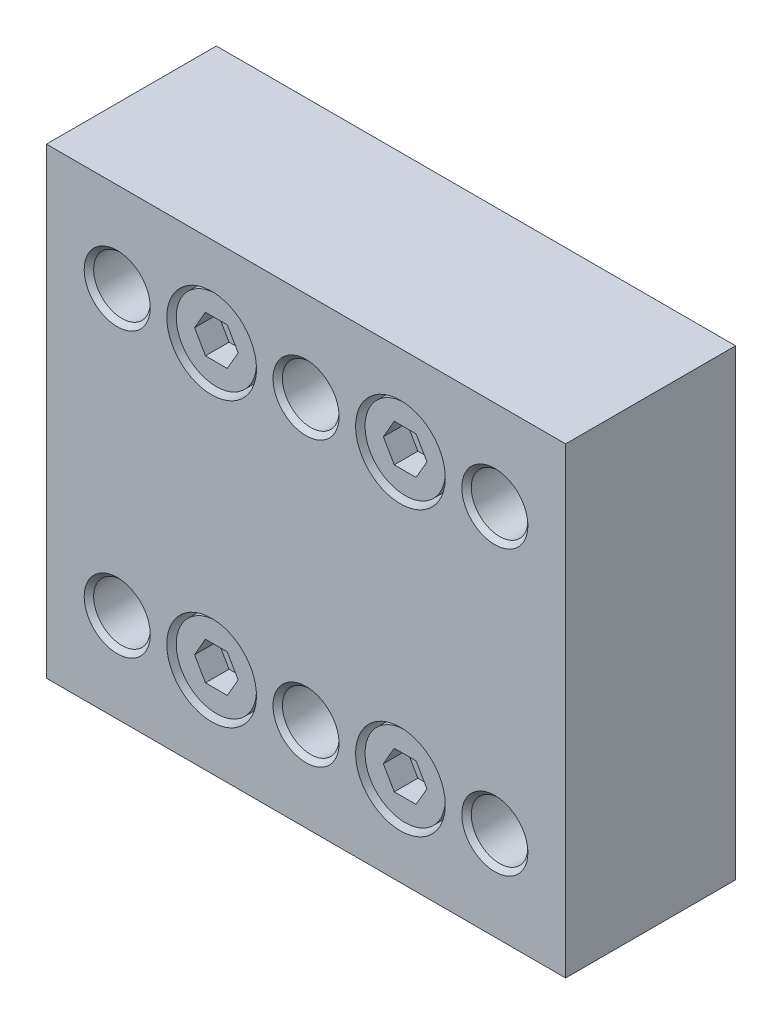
ISO-10303-21;
HEADER;
FILE_DESCRIPTION(('STEP AP214'),'2;1');
FILE_NAME('part.step','',(''),(''),'','','');
FILE_SCHEMA(('AUTOMOTIVE_DESIGN { 1 0 10303 214 1 1 1 1 }'));
ENDSEC;
DATA;
#1=APPLICATION_CONTEXT('core data for automotive mechanical design processes');
#2=APPLICATION_PROTOCOL_DEFINITION('international standard','automotive_design',2000,#1);
#3=PRODUCT_CONTEXT('',#1,'mechanical');
#4=PRODUCT('Part','Part','',(#3));
#5=PRODUCT_RELATED_PRODUCT_CATEGORY('part','',(#4));
#6=PRODUCT_DEFINITION_FORMATION('','',#4);
#7=PRODUCT_DEFINITION_CONTEXT('part definition',#1,'design');
#8=PRODUCT_DEFINITION('design','',#6,#7);
#9=PRODUCT_DEFINITION_SHAPE('','',#8);
#10=(LENGTH_UNIT() NAMED_UNIT(*) SI_UNIT(.MILLI.,.METRE.));
#11=(NAMED_UNIT(*) PLANE_ANGLE_UNIT() SI_UNIT($,.RADIAN.));
#12=(NAMED_UNIT(*) SI_UNIT($,.STERADIAN.) SOLID_ANGLE_UNIT());
#13=UNCERTAINTY_MEASURE_WITH_UNIT(LENGTH_MEASURE(1.E-05),#10,'distance_accuracy_value','');
#14=(GEOMETRIC_REPRESENTATION_CONTEXT(3) GLOBAL_UNCERTAINTY_ASSIGNED_CONTEXT((#13)) GLOBAL_UNIT_ASSIGNED_CONTEXT((#10,
#11,#12)) REPRESENTATION_CONTEXT('',''));
#15=CARTESIAN_POINT('',(0.,0.,0.));
#16=DIRECTION('',(0.,0.,1.));
#17=DIRECTION('',(1.,0.,0.));
#18=AXIS2_PLACEMENT_3D('',#15,#16,#17);
#19=CARTESIAN_POINT('',(10.,-15.,12.5));
#20=DIRECTION('',(0.,0.,-1.));
#21=DIRECTION('',(0.,-1.,0.));
#22=AXIS2_PLACEMENT_3D('',#19,#20,#21);
#23=PLANE('',#22);
#24=CARTESIAN_POINT('',(10.,-15.,12.5));
#25=DIRECTION('',(0.,0.,1.));
#26=DIRECTION('',(0.,-1.,0.));
#27=AXIS2_PLACEMENT_3D('',#24,#25,#26);
#28=CIRCLE('',#27,4.75);
#29=CARTESIAN_POINT('',(10.,-19.75,12.5));
#30=VERTEX_POINT('',#29);
#31=EDGE_CURVE('E518',#30,#30,#28,.T.);
#32=ORIENTED_EDGE('',*,*,#31,.T.);
#33=EDGE_LOOP('',(#32));
#34=FACE_BOUND('',#33,.T.);
#35=CARTESIAN_POINT('',(10.,-15.,12.5));
#36=DIRECTION('',(0.,0.,-1.));
#37=DIRECTION('',(0.,-1.,0.));
#38=AXIS2_PLACEMENT_3D('',#35,#36,#37);
#39=CIRCLE('',#38,4.25);
#40=CARTESIAN_POINT('',(10.,-19.25,12.5));
#41=VERTEX_POINT('',#40);
#42=EDGE_CURVE('E9',#41,#41,#39,.F.);
#43=ORIENTED_EDGE('',*,*,#42,.F.);
#44=EDGE_LOOP('',(#43));
#45=FACE_BOUND('',#44,.T.);
#46=ADVANCED_FACE('F14',(#34,#45),#23,.F.);
#47=CARTESIAN_POINT('',(10.,15.,12.5));
#48=DIRECTION('',(0.,0.,1.));
#49=DIRECTION('',(0.,1.,0.));
#50=AXIS2_PLACEMENT_3D('',#47,#48,#49);
#51=PLANE('',#50);
#52=CARTESIAN_POINT('',(10.,15.,12.5));
#53=DIRECTION('',(0.,0.,1.));
#54=DIRECTION('',(0.,1.,0.));
#55=AXIS2_PLACEMENT_3D('',#52,#53,#54);
#56=CIRCLE('',#55,4.75);
#57=CARTESIAN_POINT('',(10.,19.75,12.5));
#58=VERTEX_POINT('',#57);
#59=EDGE_CURVE('E524',#58,#58,#56,.T.);
#60=ORIENTED_EDGE('',*,*,#59,.T.);
#61=EDGE_LOOP('',(#60));
#62=FACE_BOUND('',#61,.T.);
#63=CARTESIAN_POINT('',(10.,15.,12.5));
#64=DIRECTION('',(0.,0.,1.));
#65=DIRECTION('',(0.,1.,0.));
#66=AXIS2_PLACEMENT_3D('',#63,#64,#65);
#67=CIRCLE('',#66,4.25);
#68=CARTESIAN_POINT('',(10.,19.25,12.5));
#69=VERTEX_POINT('',#68);
#70=EDGE_CURVE('E484',#69,#69,#67,.T.);
#71=ORIENTED_EDGE('',*,*,#70,.F.);
#72=EDGE_LOOP('',(#71));
#73=FACE_BOUND('',#72,.T.);
#74=ADVANCED_FACE('F577',(#62,#73),#51,.T.);
#75=CARTESIAN_POINT('',(-10.,15.,12.5));
#76=DIRECTION('',(0.,0.,-1.));
#77=DIRECTION('',(0.,-1.,0.));
#78=AXIS2_PLACEMENT_3D('',#75,#76,#77);
#79=PLANE('',#78);
#80=CARTESIAN_POINT('',(-10.,15.,12.5));
#81=DIRECTION('',(0.,0.,1.));
#82=DIRECTION('',(0.,-1.,0.));
#83=AXIS2_PLACEMENT_3D('',#80,#81,#82);
#84=CIRCLE('',#83,4.75);
#85=CARTESIAN_POINT('',(-10.,10.25,12.5));
#86=VERTEX_POINT('',#85);
#87=EDGE_CURVE('E530',#86,#86,#84,.T.);
#88=ORIENTED_EDGE('',*,*,#87,.T.);
#89=EDGE_LOOP('',(#88));
#90=FACE_BOUND('',#89,.T.);
#91=CARTESIAN_POINT('',(-10.,15.,12.5));
#92=DIRECTION('',(0.,0.,-1.));
#93=DIRECTION('',(0.,-1.,0.));
#94=AXIS2_PLACEMENT_3D('',#91,#92,#93);
#95=CIRCLE('',#94,4.25);
#96=CARTESIAN_POINT('',(-10.,10.75,12.5));
#97=VERTEX_POINT('',#96);
#98=EDGE_CURVE('E23',#97,#97,#95,.F.);
#99=ORIENTED_EDGE('',*,*,#98,.F.);
#100=EDGE_LOOP('',(#99));
#101=FACE_BOUND('',#100,.T.);
#102=ADVANCED_FACE('F584',(#90,#101),#79,.F.);
#103=CARTESIAN_POINT('',(-10.,-15.,12.5));
#104=DIRECTION('',(0.,0.,1.));
#105=DIRECTION('',(0.,1.,0.));
#106=AXIS2_PLACEMENT_3D('',#103,#104,#105);
#107=PLANE('',#106);
#108=CARTESIAN_POINT('',(-10.,-15.,12.5));
#109=DIRECTION('',(0.,0.,1.));
#110=DIRECTION('',(0.,1.,0.));
#111=AXIS2_PLACEMENT_3D('',#108,#109,#110);
#112=CIRCLE('',#111,4.75);
#113=CARTESIAN_POINT('',(-10.,-10.25,12.5));
#114=VERTEX_POINT('',#113);
#115=EDGE_CURVE('E536',#114,#114,#112,.T.);
#116=ORIENTED_EDGE('',*,*,#115,.T.);
#117=EDGE_LOOP('',(#116));
#118=FACE_BOUND('',#117,.T.);
#119=CARTESIAN_POINT('',(-10.,-15.,12.5));
#120=DIRECTION('',(0.,0.,1.));
#121=DIRECTION('',(0.,1.,0.));
#122=AXIS2_PLACEMENT_3D('',#119,#120,#121);
#123=CIRCLE('',#122,4.25);
#124=CARTESIAN_POINT('',(-10.,-10.75,12.5));
#125=VERTEX_POINT('',#124);
#126=EDGE_CURVE('E493',#125,#125,#123,.T.);
#127=ORIENTED_EDGE('',*,*,#126,.F.);
#128=EDGE_LOOP('',(#127));
#129=FACE_BOUND('',#128,.T.);
#130=ADVANCED_FACE('F603',(#118,#129),#107,.T.);
#131=CARTESIAN_POINT('',(27.5,24.5,18.));
#132=DIRECTION('',(0.,0.,1.));
#133=DIRECTION('',(0.,1.,0.));
#134=AXIS2_PLACEMENT_3D('',#131,#132,#133);
#135=PLANE('',#134);
#136=DIRECTION('',(1.,0.,0.));
#137=VECTOR('',#136,1.);
#138=CARTESIAN_POINT('',(-27.5,24.5,18.));
#139=LINE('',#138,#137);
#140=CARTESIAN_POINT('',(-27.5,24.5,18.));
#141=VERTEX_POINT('',#140);
#142=CARTESIAN_POINT('',(27.5,24.5,18.));
#143=VERTEX_POINT('',#142);
#144=EDGE_CURVE('E257',#141,#143,#139,.T.);
#145=ORIENTED_EDGE('',*,*,#144,.F.);
#146=DIRECTION('',(0.,1.,0.));
#147=VECTOR('',#146,1.);
#148=CARTESIAN_POINT('',(-27.5,24.5,18.));
#149=LINE('',#148,#147);
#150=CARTESIAN_POINT('',(-27.5,-24.5,18.));
#151=VERTEX_POINT('',#150);
#152=EDGE_CURVE('E247',#151,#141,#149,.T.);
#153=ORIENTED_EDGE('',*,*,#152,.F.);
#154=DIRECTION('',(-1.,0.,0.));
#155=VECTOR('',#154,1.);
#156=CARTESIAN_POINT('',(27.5,-24.5,18.));
#157=LINE('',#156,#155);
#158=CARTESIAN_POINT('',(27.5,-24.5,18.));
#159=VERTEX_POINT('',#158);
#160=EDGE_CURVE('E231',#159,#151,#157,.T.);
#161=ORIENTED_EDGE('',*,*,#160,.F.);
#162=DIRECTION('',(0.,-1.,0.));
#163=VECTOR('',#162,1.);
#164=CARTESIAN_POINT('',(27.5,24.5,18.));
#165=LINE('',#164,#163);
#166=EDGE_CURVE('E244',#143,#159,#165,.T.);
#167=ORIENTED_EDGE('',*,*,#166,.F.);
#168=EDGE_LOOP('',(#145,#153,#161,#167));
#169=FACE_BOUND('',#168,.T.);
#170=CARTESIAN_POINT('',(-10.,-15.,18.));
#171=DIRECTION('',(0.,0.,1.));
#172=DIRECTION('',(0.,1.,0.));
#173=AXIS2_PLACEMENT_3D('',#170,#171,#172);
#174=CIRCLE('',#173,4.75);
#175=CARTESIAN_POINT('',(-10.,-10.25,18.));
#176=VERTEX_POINT('',#175);
#177=EDGE_CURVE('E533',#176,#176,#174,.T.);
#178=ORIENTED_EDGE('',*,*,#177,.F.);
#179=EDGE_LOOP('',(#178));
#180=FACE_BOUND('',#179,.T.);
#181=CARTESIAN_POINT('',(-10.,15.,18.));
#182=DIRECTION('',(0.,0.,1.));
#183=DIRECTION('',(0.,-1.,0.));
#184=AXIS2_PLACEMENT_3D('',#181,#182,#183);
#185=CIRCLE('',#184,4.75);
#186=CARTESIAN_POINT('',(-10.,10.25,18.));
#187=VERTEX_POINT('',#186);
#188=EDGE_CURVE('E527',#187,#187,#185,.T.);
#189=ORIENTED_EDGE('',*,*,#188,.F.);
#190=EDGE_LOOP('',(#189));
#191=FACE_BOUND('',#190,.T.);
#192=CARTESIAN_POINT('',(10.,15.,18.));
#193=DIRECTION('',(0.,0.,1.));
#194=DIRECTION('',(0.,1.,0.));
#195=AXIS2_PLACEMENT_3D('',#192,#193,#194);
#196=CIRCLE('',#195,4.75);
#197=CARTESIAN_POINT('',(10.,19.75,18.));
#198=VERTEX_POINT('',#197);
#199=EDGE_CURVE('E521',#198,#198,#196,.T.);
#200=ORIENTED_EDGE('',*,*,#199,.F.);
#201=EDGE_LOOP('',(#200));
#202=FACE_BOUND('',#201,.T.);
#203=CARTESIAN_POINT('',(10.,-15.,18.));
#204=DIRECTION('',(0.,0.,1.));
#205=DIRECTION('',(0.,-1.,0.));
#206=AXIS2_PLACEMENT_3D('',#203,#204,#205);
#207=CIRCLE('',#206,4.75);
#208=CARTESIAN_POINT('',(10.,-19.75,18.));
#209=VERTEX_POINT('',#208);
#210=EDGE_CURVE('E517',#209,#209,#207,.T.);
#211=ORIENTED_EDGE('',*,*,#210,.F.);
#212=EDGE_LOOP('',(#211));
#213=FACE_BOUND('',#212,.T.);
#214=CARTESIAN_POINT('',(-20.,-15.,18.));
#215=DIRECTION('',(0.,0.,1.));
#216=DIRECTION('',(0.,1.,0.));
#217=AXIS2_PLACEMENT_3D('',#214,#215,#216);
#218=CIRCLE('',#217,3.5);
#219=CARTESIAN_POINT('',(-20.,-11.5,18.));
#220=VERTEX_POINT('',#219);
#221=EDGE_CURVE('E514',#220,#220,#218,.T.);
#222=ORIENTED_EDGE('',*,*,#221,.F.);
#223=EDGE_LOOP('',(#222));
#224=FACE_BOUND('',#223,.T.);
#225=CARTESIAN_POINT('',(0.,-15.,18.));
#226=DIRECTION('',(0.,0.,1.));
#227=DIRECTION('',(0.,1.,0.));
#228=AXIS2_PLACEMENT_3D('',#225,#226,#227);
#229=CIRCLE('',#228,3.5);
#230=CARTESIAN_POINT('',(0.,-11.5,18.));
#231=VERTEX_POINT('',#230);
#232=EDGE_CURVE('E511',#231,#231,#229,.T.);
#233=ORIENTED_EDGE('',*,*,#232,.F.);
#234=EDGE_LOOP('',(#233));
#235=FACE_BOUND('',#234,.T.);
#236=CARTESIAN_POINT('',(20.,-15.,18.));
#237=DIRECTION('',(0.,0.,1.));
#238=DIRECTION('',(0.,1.,0.));
#239=AXIS2_PLACEMENT_3D('',#236,#237,#238);
#240=CIRCLE('',#239,3.5);
#241=CARTESIAN_POINT('',(20.,-11.5,18.));
#242=VERTEX_POINT('',#241);
#243=EDGE_CURVE('E508',#242,#242,#240,.T.);
#244=ORIENTED_EDGE('',*,*,#243,.F.);
#245=EDGE_LOOP('',(#244));
#246=FACE_BOUND('',#245,.T.);
#247=CARTESIAN_POINT('',(-20.,15.,18.));
#248=DIRECTION('',(0.,0.,1.));
#249=DIRECTION('',(0.,1.,0.));
#250=AXIS2_PLACEMENT_3D('',#247,#248,#249);
#251=CIRCLE('',#250,3.5);
#252=CARTESIAN_POINT('',(-20.,18.5,18.));
#253=VERTEX_POINT('',#252);
#254=EDGE_CURVE('E505',#253,#253,#251,.T.);
#255=ORIENTED_EDGE('',*,*,#254,.F.);
#256=EDGE_LOOP('',(#255));
#257=FACE_BOUND('',#256,.T.);
#258=CARTESIAN_POINT('',(0.,15.,18.));
#259=DIRECTION('',(0.,0.,1.));
#260=DIRECTION('',(0.,1.,0.));
#261=AXIS2_PLACEMENT_3D('',#258,#259,#260);
#262=CIRCLE('',#261,3.5);
#263=CARTESIAN_POINT('',(0.,18.5,18.));
#264=VERTEX_POINT('',#263);
#265=EDGE_CURVE('E502',#264,#264,#262,.T.);
#266=ORIENTED_EDGE('',*,*,#265,.F.);
#267=EDGE_LOOP('',(#266));
#268=FACE_BOUND('',#267,.T.);
#269=CARTESIAN_POINT('',(20.,15.,18.));
#270=DIRECTION('',(0.,0.,1.));
#271=DIRECTION('',(0.,1.,0.));
#272=AXIS2_PLACEMENT_3D('',#269,#270,#271);
#273=CIRCLE('',#272,3.5);
#274=CARTESIAN_POINT('',(20.,18.5,18.));
#275=VERTEX_POINT('',#274);
#276=EDGE_CURVE('E497',#275,#275,#273,.T.);
#277=ORIENTED_EDGE('',*,*,#276,.F.);
#278=EDGE_LOOP('',(#277));
#279=FACE_BOUND('',#278,.T.);
#280=ADVANCED_FACE('F242',(#169,#180,#191,#202,#213,#224,#235,#246,#257,#268,#279),#135,.T.);
#281=CARTESIAN_POINT('',(-10.,-15.,12.5));
#282=DIRECTION('',(0.,0.,1.));
#283=DIRECTION('',(0.,1.,0.));
#284=AXIS2_PLACEMENT_3D('',#281,#282,#283);
#285=CYLINDRICAL_SURFACE('',#284,4.75);
#286=ORIENTED_EDGE('',*,*,#115,.F.);
#287=EDGE_LOOP('',(#286));
#288=FACE_BOUND('',#287,.T.);
#289=ORIENTED_EDGE('',*,*,#177,.T.);
#290=EDGE_LOOP('',(#289));
#291=FACE_BOUND('',#290,.T.);
#292=ADVANCED_FACE('F607',(#288,#291),#285,.F.);
#293=CARTESIAN_POINT('',(-10.,15.,12.5));
#294=DIRECTION('',(0.,0.,1.));
#295=DIRECTION('',(0.,1.,0.));
#296=AXIS2_PLACEMENT_3D('',#293,#294,#295);
#297=CYLINDRICAL_SURFACE('',#296,4.75);
#298=ORIENTED_EDGE('',*,*,#87,.F.);
#299=EDGE_LOOP('',(#298));
#300=FACE_BOUND('',#299,.T.);
#301=ORIENTED_EDGE('',*,*,#188,.T.);
#302=EDGE_LOOP('',(#301));
#303=FACE_BOUND('',#302,.T.);
#304=ADVANCED_FACE('F599',(#300,#303),#297,.F.);
#305=CARTESIAN_POINT('',(10.,15.,12.5));
#306=DIRECTION('',(0.,0.,1.));
#307=DIRECTION('',(0.,1.,0.));
#308=AXIS2_PLACEMENT_3D('',#305,#306,#307);
#309=CYLINDRICAL_SURFACE('',#308,4.75);
#310=ORIENTED_EDGE('',*,*,#59,.F.);
#311=EDGE_LOOP('',(#310));
#312=FACE_BOUND('',#311,.T.);
#313=ORIENTED_EDGE('',*,*,#199,.T.);
#314=EDGE_LOOP('',(#313));
#315=FACE_BOUND('',#314,.T.);
#316=ADVANCED_FACE('F594',(#312,#315),#309,.F.);
#317=CARTESIAN_POINT('',(10.,-15.,12.5));
#318=DIRECTION('',(0.,0.,1.));
#319=DIRECTION('',(0.,1.,0.));
#320=AXIS2_PLACEMENT_3D('',#317,#318,#319);
#321=CYLINDRICAL_SURFACE('',#320,4.75);
#322=ORIENTED_EDGE('',*,*,#31,.F.);
#323=EDGE_LOOP('',(#322));
#324=FACE_BOUND('',#323,.T.);
#325=ORIENTED_EDGE('',*,*,#210,.T.);
#326=EDGE_LOOP('',(#325));
#327=FACE_BOUND('',#326,.T.);
#328=ADVANCED_FACE('F592',(#324,#327),#321,.F.);
#329=CARTESIAN_POINT('',(-20.,-15.,18.));
#330=DIRECTION('',(0.,0.,1.));
#331=DIRECTION('',(0.,1.,0.));
#332=AXIS2_PLACEMENT_3D('',#329,#330,#331);
#333=CONICAL_SURFACE('',#332,3.5,0.785398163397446);
#334=CARTESIAN_POINT('',(-20.,-15.,17.5));
#335=DIRECTION('',(0.,0.,1.));
#336=DIRECTION('',(0.,-1.,0.));
#337=AXIS2_PLACEMENT_3D('',#334,#335,#336);
#338=CIRCLE('',#337,3.);
#339=CARTESIAN_POINT('',(-20.,-18.,17.5));
#340=VERTEX_POINT('',#339);
#341=EDGE_CURVE('E280',#340,#340,#338,.F.);
#342=ORIENTED_EDGE('',*,*,#341,.T.);
#343=EDGE_LOOP('',(#342));
#344=FACE_BOUND('',#343,.T.);
#345=ORIENTED_EDGE('',*,*,#221,.T.);
#346=EDGE_LOOP('',(#345));
#347=FACE_BOUND('',#346,.T.);
#348=ADVANCED_FACE('F590',(#344,#347),#333,.F.);
#349=CARTESIAN_POINT('',(0.,-15.,18.));
#350=DIRECTION('',(0.,0.,1.));
#351=DIRECTION('',(0.,1.,0.));
#352=AXIS2_PLACEMENT_3D('',#349,#350,#351);
#353=CONICAL_SURFACE('',#352,3.5,0.785398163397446);
#354=CARTESIAN_POINT('',(0.,-15.,17.5));
#355=DIRECTION('',(0.,0.,1.));
#356=DIRECTION('',(0.,-1.,0.));
#357=AXIS2_PLACEMENT_3D('',#354,#355,#356);
#358=CIRCLE('',#357,3.);
#359=CARTESIAN_POINT('',(0.,-18.,17.5));
#360=VERTEX_POINT('',#359);
#361=EDGE_CURVE('E276',#360,#360,#358,.F.);
#362=ORIENTED_EDGE('',*,*,#361,.T.);
#363=EDGE_LOOP('',(#362));
#364=FACE_BOUND('',#363,.T.);
#365=ORIENTED_EDGE('',*,*,#232,.T.);
#366=EDGE_LOOP('',(#365));
#367=FACE_BOUND('',#366,.T.);
#368=ADVANCED_FACE('F553',(#364,#367),#353,.F.);
#369=CARTESIAN_POINT('',(20.,-15.,18.));
#370=DIRECTION('',(0.,0.,1.));
#371=DIRECTION('',(0.,1.,0.));
#372=AXIS2_PLACEMENT_3D('',#369,#370,#371);
#373=CONICAL_SURFACE('',#372,3.5,0.785398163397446);
#374=CARTESIAN_POINT('',(20.,-15.,17.5));
#375=DIRECTION('',(0.,0.,1.));
#376=DIRECTION('',(0.,-1.,0.));
#377=AXIS2_PLACEMENT_3D('',#374,#375,#376);
#378=CIRCLE('',#377,3.);
#379=CARTESIAN_POINT('',(20.,-18.,17.5));
#380=VERTEX_POINT('',#379);
#381=EDGE_CURVE('E18',#380,#380,#378,.F.);
#382=ORIENTED_EDGE('',*,*,#381,.T.);
#383=EDGE_LOOP('',(#382));
#384=FACE_BOUND('',#383,.T.);
#385=ORIENTED_EDGE('',*,*,#243,.T.);
#386=EDGE_LOOP('',(#385));
#387=FACE_BOUND('',#386,.T.);
#388=ADVANCED_FACE('F660',(#384,#387),#373,.F.);
#389=CARTESIAN_POINT('',(-20.,15.,18.));
#390=DIRECTION('',(0.,0.,1.));
#391=DIRECTION('',(0.,1.,0.));
#392=AXIS2_PLACEMENT_3D('',#389,#390,#391);
#393=CONICAL_SURFACE('',#392,3.5,0.785398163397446);
#394=CARTESIAN_POINT('',(-20.,15.,17.5));
#395=DIRECTION('',(0.,0.,1.));
#396=DIRECTION('',(0.,-1.,0.));
#397=AXIS2_PLACEMENT_3D('',#394,#395,#396);
#398=CIRCLE('',#397,3.);
#399=CARTESIAN_POINT('',(-20.,12.,17.5));
#400=VERTEX_POINT('',#399);
#401=EDGE_CURVE('E292',#400,#400,#398,.F.);
#402=ORIENTED_EDGE('',*,*,#401,.T.);
#403=EDGE_LOOP('',(#402));
#404=FACE_BOUND('',#403,.T.);
#405=ORIENTED_EDGE('',*,*,#254,.T.);
#406=EDGE_LOOP('',(#405));
#407=FACE_BOUND('',#406,.T.);
#408=ADVANCED_FACE('F667',(#404,#407),#393,.F.);
#409=CARTESIAN_POINT('',(0.,15.,18.));
#410=DIRECTION('',(0.,0.,1.));
#411=DIRECTION('',(0.,1.,0.));
#412=AXIS2_PLACEMENT_3D('',#409,#410,#411);
#413=CONICAL_SURFACE('',#412,3.5,0.785398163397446);
#414=CARTESIAN_POINT('',(0.,15.,17.5));
#415=DIRECTION('',(0.,0.,1.));
#416=DIRECTION('',(0.,-1.,0.));
#417=AXIS2_PLACEMENT_3D('',#414,#415,#416);
#418=CIRCLE('',#417,3.);
#419=CARTESIAN_POINT('',(0.,12.,17.5));
#420=VERTEX_POINT('',#419);
#421=EDGE_CURVE('E288',#420,#420,#418,.F.);
#422=ORIENTED_EDGE('',*,*,#421,.T.);
#423=EDGE_LOOP('',(#422));
#424=FACE_BOUND('',#423,.T.);
#425=ORIENTED_EDGE('',*,*,#265,.T.);
#426=EDGE_LOOP('',(#425));
#427=FACE_BOUND('',#426,.T.);
#428=ADVANCED_FACE('F676',(#424,#427),#413,.F.);
#429=CARTESIAN_POINT('',(20.,15.,18.));
#430=DIRECTION('',(0.,0.,1.));
#431=DIRECTION('',(0.,1.,0.));
#432=AXIS2_PLACEMENT_3D('',#429,#430,#431);
#433=CONICAL_SURFACE('',#432,3.5,0.785398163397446);
#434=CARTESIAN_POINT('',(20.,15.,17.5));
#435=DIRECTION('',(0.,0.,1.));
#436=DIRECTION('',(0.,-1.,0.));
#437=AXIS2_PLACEMENT_3D('',#434,#435,#436);
#438=CIRCLE('',#437,3.);
#439=CARTESIAN_POINT('',(20.,12.,17.5));
#440=VERTEX_POINT('',#439);
#441=EDGE_CURVE('E284',#440,#440,#438,.F.);
#442=ORIENTED_EDGE('',*,*,#441,.T.);
#443=EDGE_LOOP('',(#442));
#444=FACE_BOUND('',#443,.T.);
#445=ORIENTED_EDGE('',*,*,#276,.T.);
#446=EDGE_LOOP('',(#445));
#447=FACE_BOUND('',#446,.T.);
#448=ADVANCED_FACE('F685',(#444,#447),#433,.F.);
#449=CARTESIAN_POINT('',(-10.,-15.,17.5));
#450=DIRECTION('',(0.,0.,-1.));
#451=DIRECTION('',(0.,-1.,0.));
#452=AXIS2_PLACEMENT_3D('',#449,#450,#451);
#453=CYLINDRICAL_SURFACE('',#452,4.25);
#454=CARTESIAN_POINT('',(-10.,-15.,17.5));
#455=DIRECTION('',(0.,0.,1.));
#456=DIRECTION('',(0.,1.,0.));
#457=AXIS2_PLACEMENT_3D('',#454,#455,#456);
#458=CIRCLE('',#457,4.25);
#459=CARTESIAN_POINT('',(-10.,-10.75,17.5));
#460=VERTEX_POINT('',#459);
#461=EDGE_CURVE('E494',#460,#460,#458,.T.);
#462=ORIENTED_EDGE('',*,*,#461,.F.);
#463=EDGE_LOOP('',(#462));
#464=FACE_BOUND('',#463,.T.);
#465=ORIENTED_EDGE('',*,*,#126,.T.);
#466=EDGE_LOOP('',(#465));
#467=FACE_BOUND('',#466,.T.);
#468=ADVANCED_FACE('F694',(#464,#467),#453,.T.);
#469=CARTESIAN_POINT('',(-10.,-15.,17.5));
#470=DIRECTION('',(0.,0.,1.));
#471=DIRECTION('',(0.,1.,0.));
#472=AXIS2_PLACEMENT_3D('',#469,#470,#471);
#473=PLANE('',#472);
#474=DIRECTION('',(-0.5,0.866025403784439,0.));
#475=VECTOR('',#474,1.);
#476=CARTESIAN_POINT('',(-7.6905989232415,-15.,17.5));
#477=LINE('',#476,#475);
#478=CARTESIAN_POINT('',(-7.6905989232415,-15.,17.5));
#479=VERTEX_POINT('',#478);
#480=CARTESIAN_POINT('',(-8.84529946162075,-13.,17.5));
#481=VERTEX_POINT('',#480);
#482=EDGE_CURVE('E423',#479,#481,#477,.T.);
#483=ORIENTED_EDGE('',*,*,#482,.F.);
#484=DIRECTION('',(0.5,0.866025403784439,0.));
#485=VECTOR('',#484,1.);
#486=CARTESIAN_POINT('',(-8.84529946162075,-17.,17.5));
#487=LINE('',#486,#485);
#488=CARTESIAN_POINT('',(-8.84529946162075,-17.,17.5));
#489=VERTEX_POINT('',#488);
#490=EDGE_CURVE('E438',#489,#479,#487,.T.);
#491=ORIENTED_EDGE('',*,*,#490,.F.);
#492=DIRECTION('',(1.,0.,0.));
#493=VECTOR('',#492,1.);
#494=CARTESIAN_POINT('',(-11.1547005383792,-17.,17.5));
#495=LINE('',#494,#493);
#496=CARTESIAN_POINT('',(-11.1547005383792,-17.,17.5));
#497=VERTEX_POINT('',#496);
#498=EDGE_CURVE('E464',#497,#489,#495,.T.);
#499=ORIENTED_EDGE('',*,*,#498,.F.);
#500=DIRECTION('',(0.5,-0.866025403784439,0.));
#501=VECTOR('',#500,1.);
#502=CARTESIAN_POINT('',(-12.3094010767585,-15.,17.5));
#503=LINE('',#502,#501);
#504=CARTESIAN_POINT('',(-12.3094010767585,-15.,17.5));
#505=VERTEX_POINT('',#504);
#506=EDGE_CURVE('E461',#505,#497,#503,.T.);
#507=ORIENTED_EDGE('',*,*,#506,.F.);
#508=DIRECTION('',(-0.5,-0.866025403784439,0.));
#509=VECTOR('',#508,1.);
#510=CARTESIAN_POINT('',(-11.1547005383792,-13.,17.5));
#511=LINE('',#510,#509);
#512=CARTESIAN_POINT('',(-11.1547005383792,-13.,17.5));
#513=VERTEX_POINT('',#512);
#514=EDGE_CURVE('E458',#513,#505,#511,.T.);
#515=ORIENTED_EDGE('',*,*,#514,.F.);
#516=DIRECTION('',(-1.,0.,0.));
#517=VECTOR('',#516,1.);
#518=CARTESIAN_POINT('',(-8.84529946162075,-13.,17.5));
#519=LINE('',#518,#517);
#520=EDGE_CURVE('E455',#481,#513,#519,.T.);
#521=ORIENTED_EDGE('',*,*,#520,.F.);
#522=EDGE_LOOP('',(#483,#491,#499,#507,#515,#521));
#523=FACE_BOUND('',#522,.T.);
#524=ORIENTED_EDGE('',*,*,#461,.T.);
#525=EDGE_LOOP('',(#524));
#526=FACE_BOUND('',#525,.T.);
#527=ADVANCED_FACE('F703',(#523,#526),#473,.T.);
#528=CARTESIAN_POINT('',(-10.,15.,17.5));
#529=DIRECTION('',(0.,0.,-1.));
#530=DIRECTION('',(0.,-1.,0.));
#531=AXIS2_PLACEMENT_3D('',#528,#529,#530);
#532=CYLINDRICAL_SURFACE('',#531,4.25);
#533=CARTESIAN_POINT('',(-10.,15.,17.5));
#534=DIRECTION('',(0.,0.,1.));
#535=DIRECTION('',(0.,1.,0.));
#536=AXIS2_PLACEMENT_3D('',#533,#534,#535);
#537=CIRCLE('',#536,4.25);
#538=CARTESIAN_POINT('',(-10.,19.25,17.5));
#539=VERTEX_POINT('',#538);
#540=EDGE_CURVE('E488',#539,#539,#537,.T.);
#541=ORIENTED_EDGE('',*,*,#540,.F.);
#542=EDGE_LOOP('',(#541));
#543=FACE_BOUND('',#542,.T.);
#544=ORIENTED_EDGE('',*,*,#98,.T.);
#545=EDGE_LOOP('',(#544));
#546=FACE_BOUND('',#545,.T.);
#547=ADVANCED_FACE('F712',(#543,#546),#532,.T.);
#548=CARTESIAN_POINT('',(-10.,15.,17.5));
#549=DIRECTION('',(0.,0.,1.));
#550=DIRECTION('',(0.,1.,0.));
#551=AXIS2_PLACEMENT_3D('',#548,#549,#550);
#552=PLANE('',#551);
#553=DIRECTION('',(-0.5,0.866025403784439,0.));
#554=VECTOR('',#553,1.);
#555=CARTESIAN_POINT('',(-7.6905989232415,15.,17.5));
#556=LINE('',#555,#554);
#557=CARTESIAN_POINT('',(-7.6905989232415,15.,17.5));
#558=VERTEX_POINT('',#557);
#559=CARTESIAN_POINT('',(-8.84529946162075,17.,17.5));
#560=VERTEX_POINT('',#559);
#561=EDGE_CURVE('E39',#558,#560,#556,.T.);
#562=ORIENTED_EDGE('',*,*,#561,.F.);
#563=DIRECTION('',(0.5,0.866025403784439,0.));
#564=VECTOR('',#563,1.);
#565=CARTESIAN_POINT('',(-8.84529946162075,13.,17.5));
#566=LINE('',#565,#564);
#567=CARTESIAN_POINT('',(-8.84529946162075,13.,17.5));
#568=VERTEX_POINT('',#567);
#569=EDGE_CURVE('E343',#568,#558,#566,.T.);
#570=ORIENTED_EDGE('',*,*,#569,.F.);
#571=DIRECTION('',(1.,0.,0.));
#572=VECTOR('',#571,1.);
#573=CARTESIAN_POINT('',(-11.1547005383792,13.,17.5));
#574=LINE('',#573,#572);
#575=CARTESIAN_POINT('',(-11.1547005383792,13.,17.5));
#576=VERTEX_POINT('',#575);
#577=EDGE_CURVE('E369',#576,#568,#574,.T.);
#578=ORIENTED_EDGE('',*,*,#577,.F.);
#579=DIRECTION('',(0.5,-0.866025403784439,0.));
#580=VECTOR('',#579,1.);
#581=CARTESIAN_POINT('',(-12.3094010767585,15.,17.5));
#582=LINE('',#581,#580);
#583=CARTESIAN_POINT('',(-12.3094010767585,15.,17.5));
#584=VERTEX_POINT('',#583);
#585=EDGE_CURVE('E366',#584,#576,#582,.T.);
#586=ORIENTED_EDGE('',*,*,#585,.F.);
#587=DIRECTION('',(-0.5,-0.866025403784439,0.));
#588=VECTOR('',#587,1.);
#589=CARTESIAN_POINT('',(-11.1547005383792,17.,17.5));
#590=LINE('',#589,#588);
#591=CARTESIAN_POINT('',(-11.1547005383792,17.,17.5));
#592=VERTEX_POINT('',#591);
#593=EDGE_CURVE('E363',#592,#584,#590,.T.);
#594=ORIENTED_EDGE('',*,*,#593,.F.);
#595=DIRECTION('',(-1.,0.,0.));
#596=VECTOR('',#595,1.);
#597=CARTESIAN_POINT('',(-8.84529946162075,17.,17.5));
#598=LINE('',#597,#596);
#599=EDGE_CURVE('E360',#560,#592,#598,.T.);
#600=ORIENTED_EDGE('',*,*,#599,.F.);
#601=EDGE_LOOP('',(#562,#570,#578,#586,#594,#600));
#602=FACE_BOUND('',#601,.T.);
#603=ORIENTED_EDGE('',*,*,#540,.T.);
#604=EDGE_LOOP('',(#603));
#605=FACE_BOUND('',#604,.T.);
#606=ADVANCED_FACE('F721',(#602,#605),#552,.T.);
#607=CARTESIAN_POINT('',(10.,15.,17.5));
#608=DIRECTION('',(0.,0.,-1.));
#609=DIRECTION('',(0.,-1.,0.));
#610=AXIS2_PLACEMENT_3D('',#607,#608,#609);
#611=CYLINDRICAL_SURFACE('',#610,4.25);
#612=CARTESIAN_POINT('',(10.,15.,17.5));
#613=DIRECTION('',(0.,0.,1.));
#614=DIRECTION('',(0.,1.,0.));
#615=AXIS2_PLACEMENT_3D('',#612,#613,#614);
#616=CIRCLE('',#615,4.25);
#617=CARTESIAN_POINT('',(10.,19.25,17.5));
#618=VERTEX_POINT('',#617);
#619=EDGE_CURVE('E485',#618,#618,#616,.T.);
#620=ORIENTED_EDGE('',*,*,#619,.F.);
#621=EDGE_LOOP('',(#620));
#622=FACE_BOUND('',#621,.T.);
#623=ORIENTED_EDGE('',*,*,#70,.T.);
#624=EDGE_LOOP('',(#623));
#625=FACE_BOUND('',#624,.T.);
#626=ADVANCED_FACE('F730',(#622,#625),#611,.T.);
#627=CARTESIAN_POINT('',(10.,15.,17.5));
#628=DIRECTION('',(0.,0.,1.));
#629=DIRECTION('',(0.,1.,0.));
#630=AXIS2_PLACEMENT_3D('',#627,#628,#629);
#631=PLANE('',#630);
#632=DIRECTION('',(-0.5,0.866025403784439,0.));
#633=VECTOR('',#632,1.);
#634=CARTESIAN_POINT('',(12.3094010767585,15.,17.5));
#635=LINE('',#634,#633);
#636=CARTESIAN_POINT('',(12.3094010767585,15.,17.5));
#637=VERTEX_POINT('',#636);
#638=CARTESIAN_POINT('',(11.1547005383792,17.,17.5));
#639=VERTEX_POINT('',#638);
#640=EDGE_CURVE('E31',#637,#639,#635,.T.);
#641=ORIENTED_EDGE('',*,*,#640,.F.);
#642=DIRECTION('',(0.5,0.866025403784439,0.));
#643=VECTOR('',#642,1.);
#644=CARTESIAN_POINT('',(11.1547005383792,13.,17.5));
#645=LINE('',#644,#643);
#646=CARTESIAN_POINT('',(11.1547005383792,13.,17.5));
#647=VERTEX_POINT('',#646);
#648=EDGE_CURVE('E297',#647,#637,#645,.T.);
#649=ORIENTED_EDGE('',*,*,#648,.F.);
#650=DIRECTION('',(1.,0.,0.));
#651=VECTOR('',#650,1.);
#652=CARTESIAN_POINT('',(8.84529946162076,13.,17.5));
#653=LINE('',#652,#651);
#654=CARTESIAN_POINT('',(8.84529946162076,13.,17.5));
#655=VERTEX_POINT('',#654);
#656=EDGE_CURVE('E323',#655,#647,#653,.T.);
#657=ORIENTED_EDGE('',*,*,#656,.F.);
#658=DIRECTION('',(0.5,-0.866025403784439,0.));
#659=VECTOR('',#658,1.);
#660=CARTESIAN_POINT('',(7.6905989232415,15.,17.5));
#661=LINE('',#660,#659);
#662=CARTESIAN_POINT('',(7.6905989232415,15.,17.5));
#663=VERTEX_POINT('',#662);
#664=EDGE_CURVE('E320',#663,#655,#661,.T.);
#665=ORIENTED_EDGE('',*,*,#664,.F.);
#666=DIRECTION('',(-0.5,-0.866025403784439,0.));
#667=VECTOR('',#666,1.);
#668=CARTESIAN_POINT('',(8.84529946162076,17.,17.5));
#669=LINE('',#668,#667);
#670=CARTESIAN_POINT('',(8.84529946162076,17.,17.5));
#671=VERTEX_POINT('',#670);
#672=EDGE_CURVE('E317',#671,#663,#669,.T.);
#673=ORIENTED_EDGE('',*,*,#672,.F.);
#674=DIRECTION('',(-1.,0.,0.));
#675=VECTOR('',#674,1.);
#676=CARTESIAN_POINT('',(11.1547005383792,17.,17.5));
#677=LINE('',#676,#675);
#678=EDGE_CURVE('E314',#639,#671,#677,.T.);
#679=ORIENTED_EDGE('',*,*,#678,.F.);
#680=EDGE_LOOP('',(#641,#649,#657,#665,#673,#679));
#681=FACE_BOUND('',#680,.T.);
#682=ORIENTED_EDGE('',*,*,#619,.T.);
#683=EDGE_LOOP('',(#682));
#684=FACE_BOUND('',#683,.T.);
#685=ADVANCED_FACE('F739',(#681,#684),#631,.T.);
#686=CARTESIAN_POINT('',(10.,-15.,17.5));
#687=DIRECTION('',(0.,0.,-1.));
#688=DIRECTION('',(0.,-1.,0.));
#689=AXIS2_PLACEMENT_3D('',#686,#687,#688);
#690=CYLINDRICAL_SURFACE('',#689,4.25);
#691=CARTESIAN_POINT('',(10.,-15.,17.5));
#692=DIRECTION('',(0.,0.,1.));
#693=DIRECTION('',(0.,1.,0.));
#694=AXIS2_PLACEMENT_3D('',#691,#692,#693);
#695=CIRCLE('',#694,4.25);
#696=CARTESIAN_POINT('',(10.,-10.75,17.5));
#697=VERTEX_POINT('',#696);
#698=EDGE_CURVE('E471',#697,#697,#695,.T.);
#699=ORIENTED_EDGE('',*,*,#698,.F.);
#700=EDGE_LOOP('',(#699));
#701=FACE_BOUND('',#700,.T.);
#702=ORIENTED_EDGE('',*,*,#42,.T.);
#703=EDGE_LOOP('',(#702));
#704=FACE_BOUND('',#703,.T.);
#705=ADVANCED_FACE('F748',(#701,#704),#690,.T.);
#706=CARTESIAN_POINT('',(10.,-15.,17.5));
#707=DIRECTION('',(0.,0.,1.));
#708=DIRECTION('',(0.,1.,0.));
#709=AXIS2_PLACEMENT_3D('',#706,#707,#708);
#710=PLANE('',#709);
#711=DIRECTION('',(-0.5,0.866025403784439,0.));
#712=VECTOR('',#711,1.);
#713=CARTESIAN_POINT('',(12.3094010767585,-15.,17.5));
#714=LINE('',#713,#712);
#715=CARTESIAN_POINT('',(12.3094010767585,-15.,17.5));
#716=VERTEX_POINT('',#715);
#717=CARTESIAN_POINT('',(11.1547005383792,-13.,17.5));
#718=VERTEX_POINT('',#717);
#719=EDGE_CURVE('E376',#716,#718,#714,.T.);
#720=ORIENTED_EDGE('',*,*,#719,.F.);
#721=DIRECTION('',(0.5,0.866025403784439,0.));
#722=VECTOR('',#721,1.);
#723=CARTESIAN_POINT('',(11.1547005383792,-17.,17.5));
#724=LINE('',#723,#722);
#725=CARTESIAN_POINT('',(11.1547005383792,-17.,17.5));
#726=VERTEX_POINT('',#725);
#727=EDGE_CURVE('E390',#726,#716,#724,.T.);
#728=ORIENTED_EDGE('',*,*,#727,.F.);
#729=DIRECTION('',(1.,0.,0.));
#730=VECTOR('',#729,1.);
#731=CARTESIAN_POINT('',(8.84529946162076,-17.,17.5));
#732=LINE('',#731,#730);
#733=CARTESIAN_POINT('',(8.84529946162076,-17.,17.5));
#734=VERTEX_POINT('',#733);
#735=EDGE_CURVE('E416',#734,#726,#732,.T.);
#736=ORIENTED_EDGE('',*,*,#735,.F.);
#737=DIRECTION('',(0.5,-0.866025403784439,0.));
#738=VECTOR('',#737,1.);
#739=CARTESIAN_POINT('',(7.6905989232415,-15.,17.5));
#740=LINE('',#739,#738);
#741=CARTESIAN_POINT('',(7.6905989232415,-15.,17.5));
#742=VERTEX_POINT('',#741);
#743=EDGE_CURVE('E413',#742,#734,#740,.T.);
#744=ORIENTED_EDGE('',*,*,#743,.F.);
#745=DIRECTION('',(-0.5,-0.866025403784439,0.));
#746=VECTOR('',#745,1.);
#747=CARTESIAN_POINT('',(8.84529946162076,-13.,17.5));
#748=LINE('',#747,#746);
#749=CARTESIAN_POINT('',(8.84529946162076,-13.,17.5));
#750=VERTEX_POINT('',#749);
#751=EDGE_CURVE('E410',#750,#742,#748,.T.);
#752=ORIENTED_EDGE('',*,*,#751,.F.);
#753=DIRECTION('',(-1.,0.,0.));
#754=VECTOR('',#753,1.);
#755=CARTESIAN_POINT('',(11.1547005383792,-13.,17.5));
#756=LINE('',#755,#754);
#757=EDGE_CURVE('E407',#718,#750,#756,.T.);
#758=ORIENTED_EDGE('',*,*,#757,.F.);
#759=EDGE_LOOP('',(#720,#728,#736,#744,#752,#758));
#760=FACE_BOUND('',#759,.T.);
#761=ORIENTED_EDGE('',*,*,#698,.T.);
#762=EDGE_LOOP('',(#761));
#763=FACE_BOUND('',#762,.T.);
#764=ADVANCED_FACE('F757',(#760,#763),#710,.T.);
#765=CARTESIAN_POINT('',(-7.6905989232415,-15.,15.));
#766=DIRECTION('',(0.866025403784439,0.5,0.));
#767=DIRECTION('',(-0.5,0.866025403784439,0.));
#768=AXIS2_PLACEMENT_3D('',#765,#766,#767);
#769=PLANE('',#768);
#770=ORIENTED_EDGE('',*,*,#482,.T.);
#771=DIRECTION('',(0.,0.,1.));
#772=VECTOR('',#771,1.);
#773=CARTESIAN_POINT('',(-8.84529946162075,-13.,15.));
#774=LINE('',#773,#772);
#775=CARTESIAN_POINT('',(-8.84529946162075,-13.,15.));
#776=VERTEX_POINT('',#775);
#777=EDGE_CURVE('E453',#776,#481,#774,.T.);
#778=ORIENTED_EDGE('',*,*,#777,.F.);
#779=DIRECTION('',(-0.5,0.866025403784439,0.));
#780=VECTOR('',#779,1.);
#781=CARTESIAN_POINT('',(-7.6905989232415,-15.,15.));
#782=LINE('',#781,#780);
#783=CARTESIAN_POINT('',(-7.6905989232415,-15.,15.));
#784=VERTEX_POINT('',#783);
#785=EDGE_CURVE('E434',#784,#776,#782,.T.);
#786=ORIENTED_EDGE('',*,*,#785,.F.);
#787=DIRECTION('',(0.,0.,1.));
#788=VECTOR('',#787,1.);
#789=CARTESIAN_POINT('',(-7.6905989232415,-15.,15.));
#790=LINE('',#789,#788);
#791=EDGE_CURVE('E469',#784,#479,#790,.T.);
#792=ORIENTED_EDGE('',*,*,#791,.T.);
#793=EDGE_LOOP('',(#770,#778,#786,#792));
#794=FACE_BOUND('',#793,.T.);
#795=ADVANCED_FACE('F766',(#794),#769,.F.);
#796=CARTESIAN_POINT('',(-8.84529946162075,-17.,15.));
#797=DIRECTION('',(0.866025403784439,-0.5,0.));
#798=DIRECTION('',(0.5,0.866025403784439,0.));
#799=AXIS2_PLACEMENT_3D('',#796,#797,#798);
#800=PLANE('',#799);
#801=ORIENTED_EDGE('',*,*,#490,.T.);
#802=ORIENTED_EDGE('',*,*,#791,.F.);
#803=DIRECTION('',(0.5,0.866025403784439,0.));
#804=VECTOR('',#803,1.);
#805=CARTESIAN_POINT('',(-8.84529946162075,-17.,15.));
#806=LINE('',#805,#804);
#807=CARTESIAN_POINT('',(-8.84529946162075,-17.,15.));
#808=VERTEX_POINT('',#807);
#809=EDGE_CURVE('E450',#808,#784,#806,.T.);
#810=ORIENTED_EDGE('',*,*,#809,.F.);
#811=DIRECTION('',(0.,0.,1.));
#812=VECTOR('',#811,1.);
#813=CARTESIAN_POINT('',(-8.84529946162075,-17.,15.));
#814=LINE('',#813,#812);
#815=EDGE_CURVE('E472',#808,#489,#814,.T.);
#816=ORIENTED_EDGE('',*,*,#815,.T.);
#817=EDGE_LOOP('',(#801,#802,#810,#816));
#818=FACE_BOUND('',#817,.T.);
#819=ADVANCED_FACE('F775',(#818),#800,.F.);
#820=CARTESIAN_POINT('',(-11.1547005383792,-17.,15.));
#821=DIRECTION('',(0.,-1.,0.));
#822=DIRECTION('',(0.,0.,1.));
#823=AXIS2_PLACEMENT_3D('',#820,#821,#822);
#824=PLANE('',#823);
#825=ORIENTED_EDGE('',*,*,#498,.T.);
#826=ORIENTED_EDGE('',*,*,#815,.F.);
#827=DIRECTION('',(1.,0.,0.));
#828=VECTOR('',#827,1.);
#829=CARTESIAN_POINT('',(-11.1547005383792,-17.,15.));
#830=LINE('',#829,#828);
#831=CARTESIAN_POINT('',(-11.1547005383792,-17.,15.));
#832=VERTEX_POINT('',#831);
#833=EDGE_CURVE('E447',#832,#808,#830,.T.);
#834=ORIENTED_EDGE('',*,*,#833,.F.);
#835=DIRECTION('',(0.,0.,1.));
#836=VECTOR('',#835,1.);
#837=CARTESIAN_POINT('',(-11.1547005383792,-17.,15.));
#838=LINE('',#837,#836);
#839=EDGE_CURVE('E474',#832,#497,#838,.T.);
#840=ORIENTED_EDGE('',*,*,#839,.T.);
#841=EDGE_LOOP('',(#825,#826,#834,#840));
#842=FACE_BOUND('',#841,.T.);
#843=ADVANCED_FACE('F784',(#842),#824,.F.);
#844=CARTESIAN_POINT('',(-12.3094010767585,-15.,15.));
#845=DIRECTION('',(-0.866025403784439,-0.5,0.));
#846=DIRECTION('',(0.5,-0.866025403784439,0.));
#847=AXIS2_PLACEMENT_3D('',#844,#845,#846);
#848=PLANE('',#847);
#849=ORIENTED_EDGE('',*,*,#506,.T.);
#850=ORIENTED_EDGE('',*,*,#839,.F.);
#851=DIRECTION('',(0.5,-0.866025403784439,0.));
#852=VECTOR('',#851,1.);
#853=CARTESIAN_POINT('',(-12.3094010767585,-15.,15.));
#854=LINE('',#853,#852);
#855=CARTESIAN_POINT('',(-12.3094010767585,-15.,15.));
#856=VERTEX_POINT('',#855);
#857=EDGE_CURVE('E444',#856,#832,#854,.T.);
#858=ORIENTED_EDGE('',*,*,#857,.F.);
#859=DIRECTION('',(0.,0.,1.));
#860=VECTOR('',#859,1.);
#861=CARTESIAN_POINT('',(-12.3094010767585,-15.,15.));
#862=LINE('',#861,#860);
#863=EDGE_CURVE('E476',#856,#505,#862,.T.);
#864=ORIENTED_EDGE('',*,*,#863,.T.);
#865=EDGE_LOOP('',(#849,#850,#858,#864));
#866=FACE_BOUND('',#865,.T.);
#867=ADVANCED_FACE('F793',(#866),#848,.F.);
#868=CARTESIAN_POINT('',(-11.1547005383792,-13.,15.));
#869=DIRECTION('',(-0.866025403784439,0.5,0.));
#870=DIRECTION('',(-0.5,-0.866025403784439,0.));
#871=AXIS2_PLACEMENT_3D('',#868,#869,#870);
#872=PLANE('',#871);
#873=ORIENTED_EDGE('',*,*,#514,.T.);
#874=ORIENTED_EDGE('',*,*,#863,.F.);
#875=DIRECTION('',(-0.5,-0.866025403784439,0.));
#876=VECTOR('',#875,1.);
#877=CARTESIAN_POINT('',(-11.1547005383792,-13.,15.));
#878=LINE('',#877,#876);
#879=CARTESIAN_POINT('',(-11.1547005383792,-13.,15.));
#880=VERTEX_POINT('',#879);
#881=EDGE_CURVE('E441',#880,#856,#878,.T.);
#882=ORIENTED_EDGE('',*,*,#881,.F.);
#883=DIRECTION('',(0.,0.,1.));
#884=VECTOR('',#883,1.);
#885=CARTESIAN_POINT('',(-11.1547005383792,-13.,15.));
#886=LINE('',#885,#884);
#887=EDGE_CURVE('E478',#880,#513,#886,.T.);
#888=ORIENTED_EDGE('',*,*,#887,.T.);
#889=EDGE_LOOP('',(#873,#874,#882,#888));
#890=FACE_BOUND('',#889,.T.);
#891=ADVANCED_FACE('F802',(#890),#872,.F.);
#892=CARTESIAN_POINT('',(-8.84529946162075,-13.,15.));
#893=DIRECTION('',(0.,1.,0.));
#894=DIRECTION('',(0.,0.,-1.));
#895=AXIS2_PLACEMENT_3D('',#892,#893,#894);
#896=PLANE('',#895);
#897=ORIENTED_EDGE('',*,*,#520,.T.);
#898=ORIENTED_EDGE('',*,*,#887,.F.);
#899=DIRECTION('',(-1.,0.,0.));
#900=VECTOR('',#899,1.);
#901=CARTESIAN_POINT('',(-8.84529946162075,-13.,15.));
#902=LINE('',#901,#900);
#903=EDGE_CURVE('E437',#776,#880,#902,.T.);
#904=ORIENTED_EDGE('',*,*,#903,.F.);
#905=ORIENTED_EDGE('',*,*,#777,.T.);
#906=EDGE_LOOP('',(#897,#898,#904,#905));
#907=FACE_BOUND('',#906,.T.);
#908=ADVANCED_FACE('F811',(#907),#896,.F.);
#909=CARTESIAN_POINT('',(-8.84529946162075,-13.,15.));
#910=DIRECTION('',(0.,0.,1.));
#911=DIRECTION('',(0.,1.,0.));
#912=AXIS2_PLACEMENT_3D('',#909,#910,#911);
#913=PLANE('',#912);
#914=ORIENTED_EDGE('',*,*,#785,.T.);
#915=ORIENTED_EDGE('',*,*,#903,.T.);
#916=ORIENTED_EDGE('',*,*,#881,.T.);
#917=ORIENTED_EDGE('',*,*,#857,.T.);
#918=ORIENTED_EDGE('',*,*,#833,.T.);
#919=ORIENTED_EDGE('',*,*,#809,.T.);
#920=EDGE_LOOP('',(#914,#915,#916,#917,#918,#919));
#921=FACE_BOUND('',#920,.T.);
#922=ADVANCED_FACE('F820',(#921),#913,.T.);
#923=CARTESIAN_POINT('',(12.3094010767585,-15.,15.));
#924=DIRECTION('',(0.866025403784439,0.5,0.));
#925=DIRECTION('',(-0.5,0.866025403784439,0.));
#926=AXIS2_PLACEMENT_3D('',#923,#924,#925);
#927=PLANE('',#926);
#928=ORIENTED_EDGE('',*,*,#719,.T.);
#929=DIRECTION('',(0.,0.,1.));
#930=VECTOR('',#929,1.);
#931=CARTESIAN_POINT('',(11.1547005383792,-13.,15.));
#932=LINE('',#931,#930);
#933=CARTESIAN_POINT('',(11.1547005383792,-13.,15.));
#934=VERTEX_POINT('',#933);
#935=EDGE_CURVE('E405',#934,#718,#932,.T.);
#936=ORIENTED_EDGE('',*,*,#935,.F.);
#937=DIRECTION('',(-0.5,0.866025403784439,0.));
#938=VECTOR('',#937,1.);
#939=CARTESIAN_POINT('',(12.3094010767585,-15.,15.));
#940=LINE('',#939,#938);
#941=CARTESIAN_POINT('',(12.3094010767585,-15.,15.));
#942=VERTEX_POINT('',#941);
#943=EDGE_CURVE('E386',#942,#934,#940,.T.);
#944=ORIENTED_EDGE('',*,*,#943,.F.);
#945=DIRECTION('',(0.,0.,1.));
#946=VECTOR('',#945,1.);
#947=CARTESIAN_POINT('',(12.3094010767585,-15.,15.));
#948=LINE('',#947,#946);
#949=EDGE_CURVE('E421',#942,#716,#948,.T.);
#950=ORIENTED_EDGE('',*,*,#949,.T.);
#951=EDGE_LOOP('',(#928,#936,#944,#950));
#952=FACE_BOUND('',#951,.T.);
#953=ADVANCED_FACE('F829',(#952),#927,.F.);
#954=CARTESIAN_POINT('',(11.1547005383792,-17.,15.));
#955=DIRECTION('',(0.866025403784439,-0.5,0.));
#956=DIRECTION('',(0.5,0.866025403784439,0.));
#957=AXIS2_PLACEMENT_3D('',#954,#955,#956);
#958=PLANE('',#957);
#959=ORIENTED_EDGE('',*,*,#727,.T.);
#960=ORIENTED_EDGE('',*,*,#949,.F.);
#961=DIRECTION('',(0.5,0.866025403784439,0.));
#962=VECTOR('',#961,1.);
#963=CARTESIAN_POINT('',(11.1547005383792,-17.,15.));
#964=LINE('',#963,#962);
#965=CARTESIAN_POINT('',(11.1547005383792,-17.,15.));
#966=VERTEX_POINT('',#965);
#967=EDGE_CURVE('E402',#966,#942,#964,.T.);
#968=ORIENTED_EDGE('',*,*,#967,.F.);
#969=DIRECTION('',(0.,0.,1.));
#970=VECTOR('',#969,1.);
#971=CARTESIAN_POINT('',(11.1547005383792,-17.,15.));
#972=LINE('',#971,#970);
#973=EDGE_CURVE('E424',#966,#726,#972,.T.);
#974=ORIENTED_EDGE('',*,*,#973,.T.);
#975=EDGE_LOOP('',(#959,#960,#968,#974));
#976=FACE_BOUND('',#975,.T.);
#977=ADVANCED_FACE('F838',(#976),#958,.F.);
#978=CARTESIAN_POINT('',(8.84529946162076,-17.,15.));
#979=DIRECTION('',(0.,-1.,0.));
#980=DIRECTION('',(0.,0.,1.));
#981=AXIS2_PLACEMENT_3D('',#978,#979,#980);
#982=PLANE('',#981);
#983=ORIENTED_EDGE('',*,*,#735,.T.);
#984=ORIENTED_EDGE('',*,*,#973,.F.);
#985=DIRECTION('',(1.,0.,0.));
#986=VECTOR('',#985,1.);
#987=CARTESIAN_POINT('',(8.84529946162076,-17.,15.));
#988=LINE('',#987,#986);
#989=CARTESIAN_POINT('',(8.84529946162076,-17.,15.));
#990=VERTEX_POINT('',#989);
#991=EDGE_CURVE('E399',#990,#966,#988,.T.);
#992=ORIENTED_EDGE('',*,*,#991,.F.);
#993=DIRECTION('',(0.,0.,1.));
#994=VECTOR('',#993,1.);
#995=CARTESIAN_POINT('',(8.84529946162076,-17.,15.));
#996=LINE('',#995,#994);
#997=EDGE_CURVE('E426',#990,#734,#996,.T.);
#998=ORIENTED_EDGE('',*,*,#997,.T.);
#999=EDGE_LOOP('',(#983,#984,#992,#998));
#1000=FACE_BOUND('',#999,.T.);
#1001=ADVANCED_FACE('F847',(#1000),#982,.F.);
#1002=CARTESIAN_POINT('',(7.6905989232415,-15.,15.));
#1003=DIRECTION('',(-0.866025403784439,-0.5,0.));
#1004=DIRECTION('',(0.5,-0.866025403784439,0.));
#1005=AXIS2_PLACEMENT_3D('',#1002,#1003,#1004);
#1006=PLANE('',#1005);
#1007=ORIENTED_EDGE('',*,*,#743,.T.);
#1008=ORIENTED_EDGE('',*,*,#997,.F.);
#1009=DIRECTION('',(0.5,-0.866025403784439,0.));
#1010=VECTOR('',#1009,1.);
#1011=CARTESIAN_POINT('',(7.6905989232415,-15.,15.));
#1012=LINE('',#1011,#1010);
#1013=CARTESIAN_POINT('',(7.6905989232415,-15.,15.));
#1014=VERTEX_POINT('',#1013);
#1015=EDGE_CURVE('E396',#1014,#990,#1012,.T.);
#1016=ORIENTED_EDGE('',*,*,#1015,.F.);
#1017=DIRECTION('',(0.,0.,1.));
#1018=VECTOR('',#1017,1.);
#1019=CARTESIAN_POINT('',(7.6905989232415,-15.,15.));
#1020=LINE('',#1019,#1018);
#1021=EDGE_CURVE('E428',#1014,#742,#1020,.T.);
#1022=ORIENTED_EDGE('',*,*,#1021,.T.);
#1023=EDGE_LOOP('',(#1007,#1008,#1016,#1022));
#1024=FACE_BOUND('',#1023,.T.);
#1025=ADVANCED_FACE('F856',(#1024),#1006,.F.);
#1026=CARTESIAN_POINT('',(8.84529946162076,-13.,15.));
#1027=DIRECTION('',(-0.866025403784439,0.5,0.));
#1028=DIRECTION('',(-0.5,-0.866025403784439,0.));
#1029=AXIS2_PLACEMENT_3D('',#1026,#1027,#1028);
#1030=PLANE('',#1029);
#1031=ORIENTED_EDGE('',*,*,#751,.T.);
#1032=ORIENTED_EDGE('',*,*,#1021,.F.);
#1033=DIRECTION('',(-0.5,-0.866025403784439,0.));
#1034=VECTOR('',#1033,1.);
#1035=CARTESIAN_POINT('',(8.84529946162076,-13.,15.));
#1036=LINE('',#1035,#1034);
#1037=CARTESIAN_POINT('',(8.84529946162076,-13.,15.));
#1038=VERTEX_POINT('',#1037);
#1039=EDGE_CURVE('E393',#1038,#1014,#1036,.T.);
#1040=ORIENTED_EDGE('',*,*,#1039,.F.);
#1041=DIRECTION('',(0.,0.,1.));
#1042=VECTOR('',#1041,1.);
#1043=CARTESIAN_POINT('',(8.84529946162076,-13.,15.));
#1044=LINE('',#1043,#1042);
#1045=EDGE_CURVE('E430',#1038,#750,#1044,.T.);
#1046=ORIENTED_EDGE('',*,*,#1045,.T.);
#1047=EDGE_LOOP('',(#1031,#1032,#1040,#1046));
#1048=FACE_BOUND('',#1047,.T.);
#1049=ADVANCED_FACE('F865',(#1048),#1030,.F.);
#1050=CARTESIAN_POINT('',(11.1547005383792,-13.,15.));
#1051=DIRECTION('',(0.,1.,0.));
#1052=DIRECTION('',(0.,0.,-1.));
#1053=AXIS2_PLACEMENT_3D('',#1050,#1051,#1052);
#1054=PLANE('',#1053);
#1055=ORIENTED_EDGE('',*,*,#757,.T.);
#1056=ORIENTED_EDGE('',*,*,#1045,.F.);
#1057=DIRECTION('',(-1.,0.,0.));
#1058=VECTOR('',#1057,1.);
#1059=CARTESIAN_POINT('',(11.1547005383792,-13.,15.));
#1060=LINE('',#1059,#1058);
#1061=EDGE_CURVE('E389',#934,#1038,#1060,.T.);
#1062=ORIENTED_EDGE('',*,*,#1061,.F.);
#1063=ORIENTED_EDGE('',*,*,#935,.T.);
#1064=EDGE_LOOP('',(#1055,#1056,#1062,#1063));
#1065=FACE_BOUND('',#1064,.T.);
#1066=ADVANCED_FACE('F874',(#1065),#1054,.F.);
#1067=CARTESIAN_POINT('',(11.1547005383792,-13.,15.));
#1068=DIRECTION('',(0.,0.,1.));
#1069=DIRECTION('',(0.,1.,0.));
#1070=AXIS2_PLACEMENT_3D('',#1067,#1068,#1069);
#1071=PLANE('',#1070);
#1072=ORIENTED_EDGE('',*,*,#943,.T.);
#1073=ORIENTED_EDGE('',*,*,#1061,.T.);
#1074=ORIENTED_EDGE('',*,*,#1039,.T.);
#1075=ORIENTED_EDGE('',*,*,#1015,.T.);
#1076=ORIENTED_EDGE('',*,*,#991,.T.);
#1077=ORIENTED_EDGE('',*,*,#967,.T.);
#1078=EDGE_LOOP('',(#1072,#1073,#1074,#1075,#1076,#1077));
#1079=FACE_BOUND('',#1078,.T.);
#1080=ADVANCED_FACE('F883',(#1079),#1071,.T.);
#1081=CARTESIAN_POINT('',(-7.6905989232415,15.,15.));
#1082=DIRECTION('',(0.866025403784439,0.5,0.));
#1083=DIRECTION('',(-0.5,0.866025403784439,0.));
#1084=AXIS2_PLACEMENT_3D('',#1081,#1082,#1083);
#1085=PLANE('',#1084);
#1086=ORIENTED_EDGE('',*,*,#561,.T.);
#1087=DIRECTION('',(0.,0.,1.));
#1088=VECTOR('',#1087,1.);
#1089=CARTESIAN_POINT('',(-8.84529946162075,17.,15.));
#1090=LINE('',#1089,#1088);
#1091=CARTESIAN_POINT('',(-8.84529946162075,17.,15.));
#1092=VERTEX_POINT('',#1091);
#1093=EDGE_CURVE('E358',#1092,#560,#1090,.T.);
#1094=ORIENTED_EDGE('',*,*,#1093,.F.);
#1095=DIRECTION('',(-0.5,0.866025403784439,0.));
#1096=VECTOR('',#1095,1.);
#1097=CARTESIAN_POINT('',(-7.6905989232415,15.,15.));
#1098=LINE('',#1097,#1096);
#1099=CARTESIAN_POINT('',(-7.6905989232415,15.,15.));
#1100=VERTEX_POINT('',#1099);
#1101=EDGE_CURVE('E339',#1100,#1092,#1098,.T.);
#1102=ORIENTED_EDGE('',*,*,#1101,.F.);
#1103=DIRECTION('',(0.,0.,1.));
#1104=VECTOR('',#1103,1.);
#1105=CARTESIAN_POINT('',(-7.6905989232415,15.,15.));
#1106=LINE('',#1105,#1104);
#1107=EDGE_CURVE('E374',#1100,#558,#1106,.T.);
#1108=ORIENTED_EDGE('',*,*,#1107,.T.);
#1109=EDGE_LOOP('',(#1086,#1094,#1102,#1108));
#1110=FACE_BOUND('',#1109,.T.);
#1111=ADVANCED_FACE('F892',(#1110),#1085,.F.);
#1112=CARTESIAN_POINT('',(-8.84529946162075,13.,15.));
#1113=DIRECTION('',(0.866025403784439,-0.5,0.));
#1114=DIRECTION('',(0.5,0.866025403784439,0.));
#1115=AXIS2_PLACEMENT_3D('',#1112,#1113,#1114);
#1116=PLANE('',#1115);
#1117=ORIENTED_EDGE('',*,*,#569,.T.);
#1118=ORIENTED_EDGE('',*,*,#1107,.F.);
#1119=DIRECTION('',(0.5,0.866025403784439,0.));
#1120=VECTOR('',#1119,1.);
#1121=CARTESIAN_POINT('',(-8.84529946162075,13.,15.));
#1122=LINE('',#1121,#1120);
#1123=CARTESIAN_POINT('',(-8.84529946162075,13.,15.));
#1124=VERTEX_POINT('',#1123);
#1125=EDGE_CURVE('E355',#1124,#1100,#1122,.T.);
#1126=ORIENTED_EDGE('',*,*,#1125,.F.);
#1127=DIRECTION('',(0.,0.,1.));
#1128=VECTOR('',#1127,1.);
#1129=CARTESIAN_POINT('',(-8.84529946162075,13.,15.));
#1130=LINE('',#1129,#1128);
#1131=EDGE_CURVE('E377',#1124,#568,#1130,.T.);
#1132=ORIENTED_EDGE('',*,*,#1131,.T.);
#1133=EDGE_LOOP('',(#1117,#1118,#1126,#1132));
#1134=FACE_BOUND('',#1133,.T.);
#1135=ADVANCED_FACE('F901',(#1134),#1116,.F.);
#1136=CARTESIAN_POINT('',(-11.1547005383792,13.,15.));
#1137=DIRECTION('',(0.,-1.,0.));
#1138=DIRECTION('',(0.,0.,1.));
#1139=AXIS2_PLACEMENT_3D('',#1136,#1137,#1138);
#1140=PLANE('',#1139);
#1141=ORIENTED_EDGE('',*,*,#577,.T.);
#1142=ORIENTED_EDGE('',*,*,#1131,.F.);
#1143=DIRECTION('',(1.,0.,0.));
#1144=VECTOR('',#1143,1.);
#1145=CARTESIAN_POINT('',(-11.1547005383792,13.,15.));
#1146=LINE('',#1145,#1144);
#1147=CARTESIAN_POINT('',(-11.1547005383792,13.,15.));
#1148=VERTEX_POINT('',#1147);
#1149=EDGE_CURVE('E352',#1148,#1124,#1146,.T.);
#1150=ORIENTED_EDGE('',*,*,#1149,.F.);
#1151=DIRECTION('',(0.,0.,1.));
#1152=VECTOR('',#1151,1.);
#1153=CARTESIAN_POINT('',(-11.1547005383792,13.,15.));
#1154=LINE('',#1153,#1152);
#1155=EDGE_CURVE('E379',#1148,#576,#1154,.T.);
#1156=ORIENTED_EDGE('',*,*,#1155,.T.);
#1157=EDGE_LOOP('',(#1141,#1142,#1150,#1156));
#1158=FACE_BOUND('',#1157,.T.);
#1159=ADVANCED_FACE('F909',(#1158),#1140,.F.);
#1160=CARTESIAN_POINT('',(-12.3094010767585,15.,15.));
#1161=DIRECTION('',(-0.866025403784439,-0.5,0.));
#1162=DIRECTION('',(0.5,-0.866025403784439,0.));
#1163=AXIS2_PLACEMENT_3D('',#1160,#1161,#1162);
#1164=PLANE('',#1163);
#1165=ORIENTED_EDGE('',*,*,#585,.T.);
#1166=ORIENTED_EDGE('',*,*,#1155,.F.);
#1167=DIRECTION('',(0.5,-0.866025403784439,0.));
#1168=VECTOR('',#1167,1.);
#1169=CARTESIAN_POINT('',(-12.3094010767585,15.,15.));
#1170=LINE('',#1169,#1168);
#1171=CARTESIAN_POINT('',(-12.3094010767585,15.,15.));
#1172=VERTEX_POINT('',#1171);
#1173=EDGE_CURVE('E349',#1172,#1148,#1170,.T.);
#1174=ORIENTED_EDGE('',*,*,#1173,.F.);
#1175=DIRECTION('',(0.,0.,1.));
#1176=VECTOR('',#1175,1.);
#1177=CARTESIAN_POINT('',(-12.3094010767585,15.,15.));
#1178=LINE('',#1177,#1176);
#1179=EDGE_CURVE('E381',#1172,#584,#1178,.T.);
#1180=ORIENTED_EDGE('',*,*,#1179,.T.);
#1181=EDGE_LOOP('',(#1165,#1166,#1174,#1180));
#1182=FACE_BOUND('',#1181,.T.);
#1183=ADVANCED_FACE('F918',(#1182),#1164,.F.);
#1184=CARTESIAN_POINT('',(-11.1547005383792,17.,15.));
#1185=DIRECTION('',(-0.866025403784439,0.5,0.));
#1186=DIRECTION('',(-0.5,-0.866025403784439,0.));
#1187=AXIS2_PLACEMENT_3D('',#1184,#1185,#1186);
#1188=PLANE('',#1187);
#1189=ORIENTED_EDGE('',*,*,#593,.T.);
#1190=ORIENTED_EDGE('',*,*,#1179,.F.);
#1191=DIRECTION('',(-0.5,-0.866025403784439,0.));
#1192=VECTOR('',#1191,1.);
#1193=CARTESIAN_POINT('',(-11.1547005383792,17.,15.));
#1194=LINE('',#1193,#1192);
#1195=CARTESIAN_POINT('',(-11.1547005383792,17.,15.));
#1196=VERTEX_POINT('',#1195);
#1197=EDGE_CURVE('E346',#1196,#1172,#1194,.T.);
#1198=ORIENTED_EDGE('',*,*,#1197,.F.);
#1199=DIRECTION('',(0.,0.,1.));
#1200=VECTOR('',#1199,1.);
#1201=CARTESIAN_POINT('',(-11.1547005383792,17.,15.));
#1202=LINE('',#1201,#1200);
#1203=EDGE_CURVE('E383',#1196,#592,#1202,.T.);
#1204=ORIENTED_EDGE('',*,*,#1203,.T.);
#1205=EDGE_LOOP('',(#1189,#1190,#1198,#1204));
#1206=FACE_BOUND('',#1205,.T.);
#1207=ADVANCED_FACE('F927',(#1206),#1188,.F.);
#1208=CARTESIAN_POINT('',(-8.84529946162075,17.,15.));
#1209=DIRECTION('',(0.,1.,0.));
#1210=DIRECTION('',(0.,0.,-1.));
#1211=AXIS2_PLACEMENT_3D('',#1208,#1209,#1210);
#1212=PLANE('',#1211);
#1213=ORIENTED_EDGE('',*,*,#599,.T.);
#1214=ORIENTED_EDGE('',*,*,#1203,.F.);
#1215=DIRECTION('',(-1.,0.,0.));
#1216=VECTOR('',#1215,1.);
#1217=CARTESIAN_POINT('',(-8.84529946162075,17.,15.));
#1218=LINE('',#1217,#1216);
#1219=EDGE_CURVE('E342',#1092,#1196,#1218,.T.);
#1220=ORIENTED_EDGE('',*,*,#1219,.F.);
#1221=ORIENTED_EDGE('',*,*,#1093,.T.);
#1222=EDGE_LOOP('',(#1213,#1214,#1220,#1221));
#1223=FACE_BOUND('',#1222,.T.);
#1224=ADVANCED_FACE('F936',(#1223),#1212,.F.);
#1225=CARTESIAN_POINT('',(-8.84529946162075,17.,15.));
#1226=DIRECTION('',(0.,0.,1.));
#1227=DIRECTION('',(0.,1.,0.));
#1228=AXIS2_PLACEMENT_3D('',#1225,#1226,#1227);
#1229=PLANE('',#1228);
#1230=ORIENTED_EDGE('',*,*,#1101,.T.);
#1231=ORIENTED_EDGE('',*,*,#1219,.T.);
#1232=ORIENTED_EDGE('',*,*,#1197,.T.);
#1233=ORIENTED_EDGE('',*,*,#1173,.T.);
#1234=ORIENTED_EDGE('',*,*,#1149,.T.);
#1235=ORIENTED_EDGE('',*,*,#1125,.T.);
#1236=EDGE_LOOP('',(#1230,#1231,#1232,#1233,#1234,#1235));
#1237=FACE_BOUND('',#1236,.T.);
#1238=ADVANCED_FACE('F945',(#1237),#1229,.T.);
#1239=CARTESIAN_POINT('',(12.3094010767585,15.,15.));
#1240=DIRECTION('',(0.866025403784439,0.5,0.));
#1241=DIRECTION('',(-0.5,0.866025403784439,0.));
#1242=AXIS2_PLACEMENT_3D('',#1239,#1240,#1241);
#1243=PLANE('',#1242);
#1244=ORIENTED_EDGE('',*,*,#640,.T.);
#1245=DIRECTION('',(0.,0.,1.));
#1246=VECTOR('',#1245,1.);
#1247=CARTESIAN_POINT('',(11.1547005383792,17.,15.));
#1248=LINE('',#1247,#1246);
#1249=CARTESIAN_POINT('',(11.1547005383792,17.,15.));
#1250=VERTEX_POINT('',#1249);
#1251=EDGE_CURVE('E312',#1250,#639,#1248,.T.);
#1252=ORIENTED_EDGE('',*,*,#1251,.F.);
#1253=DIRECTION('',(-0.5,0.866025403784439,0.));
#1254=VECTOR('',#1253,1.);
#1255=CARTESIAN_POINT('',(12.3094010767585,15.,15.));
#1256=LINE('',#1255,#1254);
#1257=CARTESIAN_POINT('',(12.3094010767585,15.,15.));
#1258=VERTEX_POINT('',#1257);
#1259=EDGE_CURVE('E293',#1258,#1250,#1256,.T.);
#1260=ORIENTED_EDGE('',*,*,#1259,.F.);
#1261=DIRECTION('',(0.,0.,1.));
#1262=VECTOR('',#1261,1.);
#1263=CARTESIAN_POINT('',(12.3094010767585,15.,15.));
#1264=LINE('',#1263,#1262);
#1265=EDGE_CURVE('E328',#1258,#637,#1264,.T.);
#1266=ORIENTED_EDGE('',*,*,#1265,.T.);
#1267=EDGE_LOOP('',(#1244,#1252,#1260,#1266));
#1268=FACE_BOUND('',#1267,.T.);
#1269=ADVANCED_FACE('F954',(#1268),#1243,.F.);
#1270=CARTESIAN_POINT('',(11.1547005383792,13.,15.));
#1271=DIRECTION('',(0.866025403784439,-0.5,0.));
#1272=DIRECTION('',(0.5,0.866025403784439,0.));
#1273=AXIS2_PLACEMENT_3D('',#1270,#1271,#1272);
#1274=PLANE('',#1273);
#1275=ORIENTED_EDGE('',*,*,#648,.T.);
#1276=ORIENTED_EDGE('',*,*,#1265,.F.);
#1277=DIRECTION('',(0.5,0.866025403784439,0.));
#1278=VECTOR('',#1277,1.);
#1279=CARTESIAN_POINT('',(11.1547005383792,13.,15.));
#1280=LINE('',#1279,#1278);
#1281=CARTESIAN_POINT('',(11.1547005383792,13.,15.));
#1282=VERTEX_POINT('',#1281);
#1283=EDGE_CURVE('E309',#1282,#1258,#1280,.T.);
#1284=ORIENTED_EDGE('',*,*,#1283,.F.);
#1285=DIRECTION('',(0.,0.,1.));
#1286=VECTOR('',#1285,1.);
#1287=CARTESIAN_POINT('',(11.1547005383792,13.,15.));
#1288=LINE('',#1287,#1286);
#1289=EDGE_CURVE('E330',#1282,#647,#1288,.T.);
#1290=ORIENTED_EDGE('',*,*,#1289,.T.);
#1291=EDGE_LOOP('',(#1275,#1276,#1284,#1290));
#1292=FACE_BOUND('',#1291,.T.);
#1293=ADVANCED_FACE('F963',(#1292),#1274,.F.);
#1294=CARTESIAN_POINT('',(8.84529946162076,13.,15.));
#1295=DIRECTION('',(0.,-1.,0.));
#1296=DIRECTION('',(0.,0.,1.));
#1297=AXIS2_PLACEMENT_3D('',#1294,#1295,#1296);
#1298=PLANE('',#1297);
#1299=ORIENTED_EDGE('',*,*,#656,.T.);
#1300=ORIENTED_EDGE('',*,*,#1289,.F.);
#1301=DIRECTION('',(1.,0.,0.));
#1302=VECTOR('',#1301,1.);
#1303=CARTESIAN_POINT('',(8.84529946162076,13.,15.));
#1304=LINE('',#1303,#1302);
#1305=CARTESIAN_POINT('',(8.84529946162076,13.,15.));
#1306=VERTEX_POINT('',#1305);
#1307=EDGE_CURVE('E306',#1306,#1282,#1304,.T.);
#1308=ORIENTED_EDGE('',*,*,#1307,.F.);
#1309=DIRECTION('',(0.,0.,1.));
#1310=VECTOR('',#1309,1.);
#1311=CARTESIAN_POINT('',(8.84529946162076,13.,15.));
#1312=LINE('',#1311,#1310);
#1313=EDGE_CURVE('E332',#1306,#655,#1312,.T.);
#1314=ORIENTED_EDGE('',*,*,#1313,.T.);
#1315=EDGE_LOOP('',(#1299,#1300,#1308,#1314));
#1316=FACE_BOUND('',#1315,.T.);
#1317=ADVANCED_FACE('F971',(#1316),#1298,.F.);
#1318=CARTESIAN_POINT('',(7.6905989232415,15.,15.));
#1319=DIRECTION('',(-0.866025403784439,-0.5,0.));
#1320=DIRECTION('',(0.5,-0.866025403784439,0.));
#1321=AXIS2_PLACEMENT_3D('',#1318,#1319,#1320);
#1322=PLANE('',#1321);
#1323=ORIENTED_EDGE('',*,*,#664,.T.);
#1324=ORIENTED_EDGE('',*,*,#1313,.F.);
#1325=DIRECTION('',(0.5,-0.866025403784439,0.));
#1326=VECTOR('',#1325,1.);
#1327=CARTESIAN_POINT('',(7.6905989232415,15.,15.));
#1328=LINE('',#1327,#1326);
#1329=CARTESIAN_POINT('',(7.6905989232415,15.,15.));
#1330=VERTEX_POINT('',#1329);
#1331=EDGE_CURVE('E303',#1330,#1306,#1328,.T.);
#1332=ORIENTED_EDGE('',*,*,#1331,.F.);
#1333=DIRECTION('',(0.,0.,1.));
#1334=VECTOR('',#1333,1.);
#1335=CARTESIAN_POINT('',(7.6905989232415,15.,15.));
#1336=LINE('',#1335,#1334);
#1337=EDGE_CURVE('E334',#1330,#663,#1336,.T.);
#1338=ORIENTED_EDGE('',*,*,#1337,.T.);
#1339=EDGE_LOOP('',(#1323,#1324,#1332,#1338));
#1340=FACE_BOUND('',#1339,.T.);
#1341=ADVANCED_FACE('F980',(#1340),#1322,.F.);
#1342=CARTESIAN_POINT('',(8.84529946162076,17.,15.));
#1343=DIRECTION('',(-0.866025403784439,0.5,0.));
#1344=DIRECTION('',(-0.5,-0.866025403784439,0.));
#1345=AXIS2_PLACEMENT_3D('',#1342,#1343,#1344);
#1346=PLANE('',#1345);
#1347=ORIENTED_EDGE('',*,*,#672,.T.);
#1348=ORIENTED_EDGE('',*,*,#1337,.F.);
#1349=DIRECTION('',(-0.5,-0.866025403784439,0.));
#1350=VECTOR('',#1349,1.);
#1351=CARTESIAN_POINT('',(8.84529946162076,17.,15.));
#1352=LINE('',#1351,#1350);
#1353=CARTESIAN_POINT('',(8.84529946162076,17.,15.));
#1354=VERTEX_POINT('',#1353);
#1355=EDGE_CURVE('E300',#1354,#1330,#1352,.T.);
#1356=ORIENTED_EDGE('',*,*,#1355,.F.);
#1357=DIRECTION('',(0.,0.,1.));
#1358=VECTOR('',#1357,1.);
#1359=CARTESIAN_POINT('',(8.84529946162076,17.,15.));
#1360=LINE('',#1359,#1358);
#1361=EDGE_CURVE('E336',#1354,#671,#1360,.T.);
#1362=ORIENTED_EDGE('',*,*,#1361,.T.);
#1363=EDGE_LOOP('',(#1347,#1348,#1356,#1362));
#1364=FACE_BOUND('',#1363,.T.);
#1365=ADVANCED_FACE('F989',(#1364),#1346,.F.);
#1366=CARTESIAN_POINT('',(11.1547005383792,17.,15.));
#1367=DIRECTION('',(0.,1.,0.));
#1368=DIRECTION('',(0.,0.,-1.));
#1369=AXIS2_PLACEMENT_3D('',#1366,#1367,#1368);
#1370=PLANE('',#1369);
#1371=ORIENTED_EDGE('',*,*,#678,.T.);
#1372=ORIENTED_EDGE('',*,*,#1361,.F.);
#1373=DIRECTION('',(-1.,0.,0.));
#1374=VECTOR('',#1373,1.);
#1375=CARTESIAN_POINT('',(11.1547005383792,17.,15.));
#1376=LINE('',#1375,#1374);
#1377=EDGE_CURVE('E296',#1250,#1354,#1376,.T.);
#1378=ORIENTED_EDGE('',*,*,#1377,.F.);
#1379=ORIENTED_EDGE('',*,*,#1251,.T.);
#1380=EDGE_LOOP('',(#1371,#1372,#1378,#1379));
#1381=FACE_BOUND('',#1380,.T.);
#1382=ADVANCED_FACE('F998',(#1381),#1370,.F.);
#1383=CARTESIAN_POINT('',(11.1547005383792,17.,15.));
#1384=DIRECTION('',(0.,0.,1.));
#1385=DIRECTION('',(0.,1.,0.));
#1386=AXIS2_PLACEMENT_3D('',#1383,#1384,#1385);
#1387=PLANE('',#1386);
#1388=ORIENTED_EDGE('',*,*,#1259,.T.);
#1389=ORIENTED_EDGE('',*,*,#1377,.T.);
#1390=ORIENTED_EDGE('',*,*,#1355,.T.);
#1391=ORIENTED_EDGE('',*,*,#1331,.T.);
#1392=ORIENTED_EDGE('',*,*,#1307,.T.);
#1393=ORIENTED_EDGE('',*,*,#1283,.T.);
#1394=EDGE_LOOP('',(#1388,#1389,#1390,#1391,#1392,#1393));
#1395=FACE_BOUND('',#1394,.T.);
#1396=ADVANCED_FACE('F1007',(#1395),#1387,.T.);
#1397=CARTESIAN_POINT('',(-20.,15.,10.));
#1398=DIRECTION('',(0.,0.,1.));
#1399=DIRECTION('',(0.,-1.,0.));
#1400=AXIS2_PLACEMENT_3D('',#1397,#1398,#1399);
#1401=PLANE('',#1400);
#1402=CARTESIAN_POINT('',(-20.,15.,10.));
#1403=DIRECTION('',(0.,0.,1.));
#1404=DIRECTION('',(0.,-1.,0.));
#1405=AXIS2_PLACEMENT_3D('',#1402,#1403,#1404);
#1406=CIRCLE('',#1405,3.);
#1407=CARTESIAN_POINT('',(-20.,12.,10.));
#1408=VERTEX_POINT('',#1407);
#1409=EDGE_CURVE('E289',#1408,#1408,#1406,.T.);
#1410=ORIENTED_EDGE('',*,*,#1409,.T.);
#1411=EDGE_LOOP('',(#1410));
#1412=FACE_BOUND('',#1411,.T.);
#1413=ADVANCED_FACE('F1016',(#1412),#1401,.T.);
#1414=CARTESIAN_POINT('',(-20.,15.,10.));
#1415=DIRECTION('',(0.,0.,1.));
#1416=DIRECTION('',(0.,-1.,0.));
#1417=AXIS2_PLACEMENT_3D('',#1414,#1415,#1416);
#1418=CYLINDRICAL_SURFACE('',#1417,3.);
#1419=ORIENTED_EDGE('',*,*,#1409,.F.);
#1420=EDGE_LOOP('',(#1419));
#1421=FACE_BOUND('',#1420,.T.);
#1422=ORIENTED_EDGE('',*,*,#401,.F.);
#1423=EDGE_LOOP('',(#1422));
#1424=FACE_BOUND('',#1423,.T.);
#1425=ADVANCED_FACE('F1025',(#1421,#1424),#1418,.F.);
#1426=CARTESIAN_POINT('',(0.,15.,10.));
#1427=DIRECTION('',(0.,0.,1.));
#1428=DIRECTION('',(0.,-1.,0.));
#1429=AXIS2_PLACEMENT_3D('',#1426,#1427,#1428);
#1430=PLANE('',#1429);
#1431=CARTESIAN_POINT('',(0.,15.,10.));
#1432=DIRECTION('',(0.,0.,1.));
#1433=DIRECTION('',(0.,-1.,0.));
#1434=AXIS2_PLACEMENT_3D('',#1431,#1432,#1433);
#1435=CIRCLE('',#1434,3.);
#1436=CARTESIAN_POINT('',(0.,12.,10.));
#1437=VERTEX_POINT('',#1436);
#1438=EDGE_CURVE('E285',#1437,#1437,#1435,.T.);
#1439=ORIENTED_EDGE('',*,*,#1438,.T.);
#1440=EDGE_LOOP('',(#1439));
#1441=FACE_BOUND('',#1440,.T.);
#1442=ADVANCED_FACE('F1034',(#1441),#1430,.T.);
#1443=CARTESIAN_POINT('',(0.,15.,10.));
#1444=DIRECTION('',(0.,0.,1.));
#1445=DIRECTION('',(0.,-1.,0.));
#1446=AXIS2_PLACEMENT_3D('',#1443,#1444,#1445);
#1447=CYLINDRICAL_SURFACE('',#1446,3.);
#1448=ORIENTED_EDGE('',*,*,#1438,.F.);
#1449=EDGE_LOOP('',(#1448));
#1450=FACE_BOUND('',#1449,.T.);
#1451=ORIENTED_EDGE('',*,*,#421,.F.);
#1452=EDGE_LOOP('',(#1451));
#1453=FACE_BOUND('',#1452,.T.);
#1454=ADVANCED_FACE('F1043',(#1450,#1453),#1447,.F.);
#1455=CARTESIAN_POINT('',(20.,15.,10.));
#1456=DIRECTION('',(0.,0.,1.));
#1457=DIRECTION('',(0.,-1.,0.));
#1458=AXIS2_PLACEMENT_3D('',#1455,#1456,#1457);
#1459=PLANE('',#1458);
#1460=CARTESIAN_POINT('',(20.,15.,10.));
#1461=DIRECTION('',(0.,0.,1.));
#1462=DIRECTION('',(0.,-1.,0.));
#1463=AXIS2_PLACEMENT_3D('',#1460,#1461,#1462);
#1464=CIRCLE('',#1463,3.);
#1465=CARTESIAN_POINT('',(20.,12.,10.));
#1466=VERTEX_POINT('',#1465);
#1467=EDGE_CURVE('E281',#1466,#1466,#1464,.T.);
#1468=ORIENTED_EDGE('',*,*,#1467,.T.);
#1469=EDGE_LOOP('',(#1468));
#1470=FACE_BOUND('',#1469,.T.);
#1471=ADVANCED_FACE('F1052',(#1470),#1459,.T.);
#1472=CARTESIAN_POINT('',(20.,15.,10.));
#1473=DIRECTION('',(0.,0.,1.));
#1474=DIRECTION('',(0.,-1.,0.));
#1475=AXIS2_PLACEMENT_3D('',#1472,#1473,#1474);
#1476=CYLINDRICAL_SURFACE('',#1475,3.);
#1477=ORIENTED_EDGE('',*,*,#1467,.F.);
#1478=EDGE_LOOP('',(#1477));
#1479=FACE_BOUND('',#1478,.T.);
#1480=ORIENTED_EDGE('',*,*,#441,.F.);
#1481=EDGE_LOOP('',(#1480));
#1482=FACE_BOUND('',#1481,.T.);
#1483=ADVANCED_FACE('F1061',(#1479,#1482),#1476,.F.);
#1484=CARTESIAN_POINT('',(-20.,-15.,10.));
#1485=DIRECTION('',(0.,0.,1.));
#1486=DIRECTION('',(0.,-1.,0.));
#1487=AXIS2_PLACEMENT_3D('',#1484,#1485,#1486);
#1488=PLANE('',#1487);
#1489=CARTESIAN_POINT('',(-20.,-15.,10.));
#1490=DIRECTION('',(0.,0.,1.));
#1491=DIRECTION('',(0.,-1.,0.));
#1492=AXIS2_PLACEMENT_3D('',#1489,#1490,#1491);
#1493=CIRCLE('',#1492,3.);
#1494=CARTESIAN_POINT('',(-20.,-18.,10.));
#1495=VERTEX_POINT('',#1494);
#1496=EDGE_CURVE('E277',#1495,#1495,#1493,.T.);
#1497=ORIENTED_EDGE('',*,*,#1496,.T.);
#1498=EDGE_LOOP('',(#1497));
#1499=FACE_BOUND('',#1498,.T.);
#1500=ADVANCED_FACE('F1070',(#1499),#1488,.T.);
#1501=CARTESIAN_POINT('',(-20.,-15.,10.));
#1502=DIRECTION('',(0.,0.,1.));
#1503=DIRECTION('',(0.,-1.,0.));
#1504=AXIS2_PLACEMENT_3D('',#1501,#1502,#1503);
#1505=CYLINDRICAL_SURFACE('',#1504,3.);
#1506=ORIENTED_EDGE('',*,*,#1496,.F.);
#1507=EDGE_LOOP('',(#1506));
#1508=FACE_BOUND('',#1507,.T.);
#1509=ORIENTED_EDGE('',*,*,#341,.F.);
#1510=EDGE_LOOP('',(#1509));
#1511=FACE_BOUND('',#1510,.T.);
#1512=ADVANCED_FACE('F571',(#1508,#1511),#1505,.F.);
#1513=CARTESIAN_POINT('',(0.,-15.,10.));
#1514=DIRECTION('',(0.,0.,1.));
#1515=DIRECTION('',(0.,-1.,0.));
#1516=AXIS2_PLACEMENT_3D('',#1513,#1514,#1515);
#1517=PLANE('',#1516);
#1518=CARTESIAN_POINT('',(0.,-15.,10.));
#1519=DIRECTION('',(0.,0.,1.));
#1520=DIRECTION('',(0.,-1.,0.));
#1521=AXIS2_PLACEMENT_3D('',#1518,#1519,#1520);
#1522=CIRCLE('',#1521,3.);
#1523=CARTESIAN_POINT('',(0.,-18.,10.));
#1524=VERTEX_POINT('',#1523);
#1525=EDGE_CURVE('E273',#1524,#1524,#1522,.T.);
#1526=ORIENTED_EDGE('',*,*,#1525,.T.);
#1527=EDGE_LOOP('',(#1526));
#1528=FACE_BOUND('',#1527,.T.);
#1529=ADVANCED_FACE('F559',(#1528),#1517,.T.);
#1530=CARTESIAN_POINT('',(0.,-15.,10.));
#1531=DIRECTION('',(0.,0.,1.));
#1532=DIRECTION('',(0.,-1.,0.));
#1533=AXIS2_PLACEMENT_3D('',#1530,#1531,#1532);
#1534=CYLINDRICAL_SURFACE('',#1533,3.);
#1535=ORIENTED_EDGE('',*,*,#1525,.F.);
#1536=EDGE_LOOP('',(#1535));
#1537=FACE_BOUND('',#1536,.T.);
#1538=ORIENTED_EDGE('',*,*,#361,.F.);
#1539=EDGE_LOOP('',(#1538));
#1540=FACE_BOUND('',#1539,.T.);
#1541=ADVANCED_FACE('F556',(#1537,#1540),#1534,.F.);
#1542=CARTESIAN_POINT('',(20.,-15.,10.));
#1543=DIRECTION('',(0.,0.,1.));
#1544=DIRECTION('',(0.,-1.,0.));
#1545=AXIS2_PLACEMENT_3D('',#1542,#1543,#1544);
#1546=PLANE('',#1545);
#1547=CARTESIAN_POINT('',(20.,-15.,10.));
#1548=DIRECTION('',(0.,0.,1.));
#1549=DIRECTION('',(0.,-1.,0.));
#1550=AXIS2_PLACEMENT_3D('',#1547,#1548,#1549);
#1551=CIRCLE('',#1550,3.);
#1552=CARTESIAN_POINT('',(20.,-18.,10.));
#1553=VERTEX_POINT('',#1552);
#1554=EDGE_CURVE('E270',#1553,#1553,#1551,.T.);
#1555=ORIENTED_EDGE('',*,*,#1554,.T.);
#1556=EDGE_LOOP('',(#1555));
#1557=FACE_BOUND('',#1556,.T.);
#1558=ADVANCED_FACE('F558',(#1557),#1546,.T.);
#1559=CARTESIAN_POINT('',(20.,-15.,10.));
#1560=DIRECTION('',(0.,0.,1.));
#1561=DIRECTION('',(0.,-1.,0.));
#1562=AXIS2_PLACEMENT_3D('',#1559,#1560,#1561);
#1563=CYLINDRICAL_SURFACE('',#1562,3.);
#1564=ORIENTED_EDGE('',*,*,#1554,.F.);
#1565=EDGE_LOOP('',(#1564));
#1566=FACE_BOUND('',#1565,.T.);
#1567=ORIENTED_EDGE('',*,*,#381,.F.);
#1568=EDGE_LOOP('',(#1567));
#1569=FACE_BOUND('',#1568,.T.);
#1570=ADVANCED_FACE('F568',(#1566,#1569),#1563,.F.);
#1571=CARTESIAN_POINT('',(27.5,24.5,0.));
#1572=DIRECTION('',(0.,0.,1.));
#1573=DIRECTION('',(0.,1.,0.));
#1574=AXIS2_PLACEMENT_3D('',#1571,#1572,#1573);
#1575=PLANE('',#1574);
#1576=DIRECTION('',(0.,1.,0.));
#1577=VECTOR('',#1576,1.);
#1578=CARTESIAN_POINT('',(27.5,-22.,0.));
#1579=LINE('',#1578,#1577);
#1580=CARTESIAN_POINT('',(27.5,-24.5,0.));
#1581=VERTEX_POINT('',#1580);
#1582=CARTESIAN_POINT('',(27.5,24.5,0.));
#1583=VERTEX_POINT('',#1582);
#1584=EDGE_CURVE('E268',#1581,#1583,#1579,.T.);
#1585=ORIENTED_EDGE('',*,*,#1584,.F.);
#1586=DIRECTION('',(1.,0.,0.));
#1587=VECTOR('',#1586,1.);
#1588=CARTESIAN_POINT('',(-27.5,-24.5,0.));
#1589=LINE('',#1588,#1587);
#1590=CARTESIAN_POINT('',(-27.5,-24.5,0.));
#1591=VERTEX_POINT('',#1590);
#1592=EDGE_CURVE('E233',#1591,#1581,#1589,.T.);
#1593=ORIENTED_EDGE('',*,*,#1592,.F.);
#1594=DIRECTION('',(0.,-1.,0.));
#1595=VECTOR('',#1594,1.);
#1596=CARTESIAN_POINT('',(-27.5,22.,0.));
#1597=LINE('',#1596,#1595);
#1598=CARTESIAN_POINT('',(-27.5,24.5,0.));
#1599=VERTEX_POINT('',#1598);
#1600=EDGE_CURVE('E236',#1599,#1591,#1597,.T.);
#1601=ORIENTED_EDGE('',*,*,#1600,.F.);
#1602=DIRECTION('',(-1.,0.,0.));
#1603=VECTOR('',#1602,1.);
#1604=CARTESIAN_POINT('',(27.5,24.5,0.));
#1605=LINE('',#1604,#1603);
#1606=EDGE_CURVE('E254',#1583,#1599,#1605,.T.);
#1607=ORIENTED_EDGE('',*,*,#1606,.F.);
#1608=EDGE_LOOP('',(#1585,#1593,#1601,#1607));
#1609=FACE_BOUND('',#1608,.T.);
#1610=ADVANCED_FACE('F16',(#1609),#1575,.F.);
#1611=CARTESIAN_POINT('',(27.5,0.,-20.));
#1612=DIRECTION('',(1.,0.,0.));
#1613=DIRECTION('',(0.,1.,0.));
#1614=AXIS2_PLACEMENT_3D('',#1611,#1612,#1613);
#1615=PLANE('',#1614);
#1616=DIRECTION('',(0.,0.,-1.));
#1617=VECTOR('',#1616,1.);
#1618=CARTESIAN_POINT('',(27.5,24.5,0.7));
#1619=LINE('',#1618,#1617);
#1620=EDGE_CURVE('E252',#143,#1583,#1619,.T.);
#1621=ORIENTED_EDGE('',*,*,#1620,.F.);
#1622=ORIENTED_EDGE('',*,*,#166,.T.);
#1623=DIRECTION('',(0.,0.,1.));
#1624=VECTOR('',#1623,1.);
#1625=CARTESIAN_POINT('',(27.5,-24.5,0.));
#1626=LINE('',#1625,#1624);
#1627=EDGE_CURVE('E226',#1581,#159,#1626,.T.);
#1628=ORIENTED_EDGE('',*,*,#1627,.F.);
#1629=ORIENTED_EDGE('',*,*,#1584,.T.);
#1630=EDGE_LOOP('',(#1621,#1622,#1628,#1629));
#1631=FACE_BOUND('',#1630,.T.);
#1632=CARTESIAN_POINT('',(27.5,22.487596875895,1.21362103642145));
#1633=VERTEX_POINT('',#1632);
#1634=VERTEX_LOOP('',#1633);
#1635=FACE_BOUND('',#1634,.T.);
#1636=CARTESIAN_POINT('',(27.5,-22.4875968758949,1.21362103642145));
#1637=VERTEX_POINT('',#1636);
#1638=VERTEX_LOOP('',#1637);
#1639=FACE_BOUND('',#1638,.T.);
#1640=ADVANCED_FACE('F249',(#1631,#1635,#1639),#1615,.T.);
#1641=CARTESIAN_POINT('',(0.,-24.5,-20.));
#1642=DIRECTION('',(0.,-1.,0.));
#1643=DIRECTION('',(1.,0.,0.));
#1644=AXIS2_PLACEMENT_3D('',#1641,#1642,#1643);
#1645=PLANE('',#1644);
#1646=DIRECTION('',(0.,0.,-1.));
#1647=VECTOR('',#1646,1.);
#1648=CARTESIAN_POINT('',(-27.5,-24.5,0.7));
#1649=LINE('',#1648,#1647);
#1650=EDGE_CURVE('E264',#151,#1591,#1649,.T.);
#1651=ORIENTED_EDGE('',*,*,#1650,.T.);
#1652=ORIENTED_EDGE('',*,*,#1592,.T.);
#1653=ORIENTED_EDGE('',*,*,#1627,.T.);
#1654=ORIENTED_EDGE('',*,*,#160,.T.);
#1655=EDGE_LOOP('',(#1651,#1652,#1653,#1654));
#1656=FACE_BOUND('',#1655,.T.);
#1657=CARTESIAN_POINT('',(25.487596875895,-24.5,1.21362103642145));
#1658=VERTEX_POINT('',#1657);
#1659=VERTEX_LOOP('',#1658);
#1660=FACE_BOUND('',#1659,.T.);
#1661=CARTESIAN_POINT('',(-25.487596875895,-24.5,1.2136210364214));
#1662=VERTEX_POINT('',#1661);
#1663=VERTEX_LOOP('',#1662);
#1664=FACE_BOUND('',#1663,.T.);
#1665=ADVANCED_FACE('F229',(#1656,#1660,#1664),#1645,.T.);
#1666=CARTESIAN_POINT('',(-27.5,0.,-20.));
#1667=DIRECTION('',(-1.,0.,0.));
#1668=DIRECTION('',(0.,-1.,0.));
#1669=AXIS2_PLACEMENT_3D('',#1666,#1667,#1668);
#1670=PLANE('',#1669);
#1671=ORIENTED_EDGE('',*,*,#1650,.F.);
#1672=ORIENTED_EDGE('',*,*,#152,.T.);
#1673=DIRECTION('',(0.,0.,1.));
#1674=VECTOR('',#1673,1.);
#1675=CARTESIAN_POINT('',(-27.5,24.5,0.));
#1676=LINE('',#1675,#1674);
#1677=EDGE_CURVE('E262',#1599,#141,#1676,.T.);
#1678=ORIENTED_EDGE('',*,*,#1677,.F.);
#1679=ORIENTED_EDGE('',*,*,#1600,.T.);
#1680=EDGE_LOOP('',(#1671,#1672,#1678,#1679));
#1681=FACE_BOUND('',#1680,.T.);
#1682=CARTESIAN_POINT('',(-27.5,-22.4875968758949,1.21362103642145));
#1683=VERTEX_POINT('',#1682);
#1684=VERTEX_LOOP('',#1683);
#1685=FACE_BOUND('',#1684,.T.);
#1686=CARTESIAN_POINT('',(-27.5,22.487596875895,1.21362103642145));
#1687=VERTEX_POINT('',#1686);
#1688=VERTEX_LOOP('',#1687);
#1689=FACE_BOUND('',#1688,.T.);
#1690=ADVANCED_FACE('F1206',(#1681,#1685,#1689),#1670,.T.);
#1691=CARTESIAN_POINT('',(0.,24.5,-20.));
#1692=DIRECTION('',(0.,1.,0.));
#1693=DIRECTION('',(-1.,0.,0.));
#1694=AXIS2_PLACEMENT_3D('',#1691,#1692,#1693);
#1695=PLANE('',#1694);
#1696=ORIENTED_EDGE('',*,*,#1620,.T.);
#1697=ORIENTED_EDGE('',*,*,#1606,.T.);
#1698=ORIENTED_EDGE('',*,*,#1677,.T.);
#1699=ORIENTED_EDGE('',*,*,#144,.T.);
#1700=EDGE_LOOP('',(#1696,#1697,#1698,#1699));
#1701=FACE_BOUND('',#1700,.T.);
#1702=CARTESIAN_POINT('',(-25.487596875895,24.5,1.21362103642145));
#1703=VERTEX_POINT('',#1702);
#1704=VERTEX_LOOP('',#1703);
#1705=FACE_BOUND('',#1704,.T.);
#1706=CARTESIAN_POINT('',(25.487596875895,24.5,1.21362103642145));
#1707=VERTEX_POINT('',#1706);
#1708=VERTEX_LOOP('',#1707);
#1709=FACE_BOUND('',#1708,.T.);
#1710=ADVANCED_FACE('F1214',(#1701,#1705,#1709),#1695,.T.);
#1711=CLOSED_SHELL('',(#46,#74,#102,#130,#280,#292,#304,#316,#328,#348,#368,#388,#408,#428,#448,
#468,#527,#547,#606,#626,#685,#705,#764,#795,#819,#843,#867,#891,#908,#922,#953,#977,#1001,
#1025,#1049,#1066,#1080,#1111,#1135,#1159,#1183,#1207,#1224,#1238,#1269,#1293,#1317,#1341,#1365,
#1382,#1396,#1413,#1425,#1442,#1454,#1471,#1483,#1500,#1512,#1529,#1541,#1558,#1570,#1610,#1640,
#1665,#1690,#1710));
#1712=MANIFOLD_SOLID_BREP('B1',#1711);
#1713=ADVANCED_BREP_SHAPE_REPRESENTATION('',(#18,#1712),#14);
#1714=SHAPE_DEFINITION_REPRESENTATION(#9,#1713);
ENDSEC;
END-ISO-10303-21;
